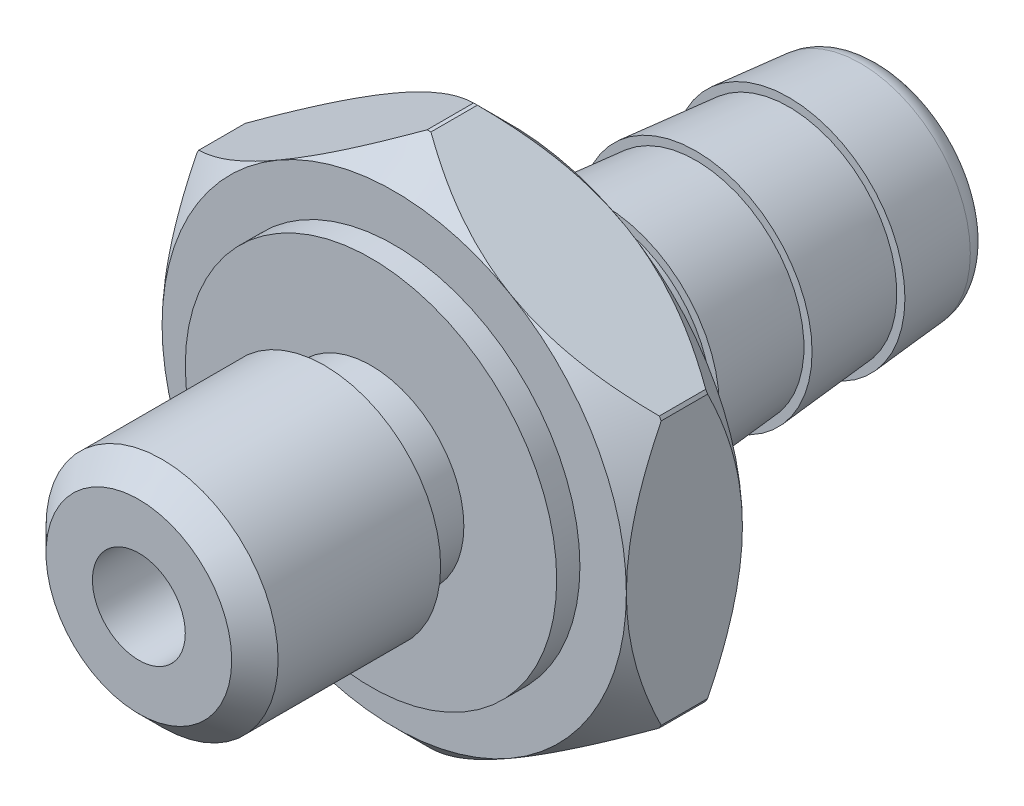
ISO-10303-21;
HEADER;
FILE_DESCRIPTION(('STEP AP214'),'2;1');
FILE_NAME('part.step','',(''),(''),'','','');
FILE_SCHEMA(('AUTOMOTIVE_DESIGN { 1 0 10303 214 1 1 1 1 }'));
ENDSEC;
DATA;
#1=APPLICATION_CONTEXT('core data for automotive mechanical design processes');
#2=APPLICATION_PROTOCOL_DEFINITION('international standard','automotive_design',2000,#1);
#3=PRODUCT_CONTEXT('',#1,'mechanical');
#4=PRODUCT('Part','Part','',(#3));
#5=PRODUCT_RELATED_PRODUCT_CATEGORY('part','',(#4));
#6=PRODUCT_DEFINITION_FORMATION('','',#4);
#7=PRODUCT_DEFINITION_CONTEXT('part definition',#1,'design');
#8=PRODUCT_DEFINITION('design','',#6,#7);
#9=PRODUCT_DEFINITION_SHAPE('','',#8);
#10=(LENGTH_UNIT() NAMED_UNIT(*) SI_UNIT(.MILLI.,.METRE.));
#11=(NAMED_UNIT(*) PLANE_ANGLE_UNIT() SI_UNIT($,.RADIAN.));
#12=(NAMED_UNIT(*) SI_UNIT($,.STERADIAN.) SOLID_ANGLE_UNIT());
#13=UNCERTAINTY_MEASURE_WITH_UNIT(LENGTH_MEASURE(1.E-05),#10,'distance_accuracy_value','');
#14=(GEOMETRIC_REPRESENTATION_CONTEXT(3) GLOBAL_UNCERTAINTY_ASSIGNED_CONTEXT((#13)) GLOBAL_UNIT_ASSIGNED_CONTEXT((#10,
#11,#12)) REPRESENTATION_CONTEXT('',''));
#15=CARTESIAN_POINT('',(0.,0.,0.));
#16=DIRECTION('',(0.,0.,1.));
#17=DIRECTION('',(1.,0.,0.));
#18=AXIS2_PLACEMENT_3D('',#15,#16,#17);
#19=CARTESIAN_POINT('',(0.,0.,0.));
#20=DIRECTION('',(0.,0.,1.));
#21=DIRECTION('',(1.,0.,0.));
#22=AXIS2_PLACEMENT_3D('',#19,#20,#21);
#23=PLANE('',#22);
#24=CARTESIAN_POINT('',(0.,0.,0.));
#25=DIRECTION('',(0.,0.,1.));
#26=DIRECTION('',(1.,0.,0.));
#27=AXIS2_PLACEMENT_3D('',#24,#25,#26);
#28=CIRCLE('',#27,5.);
#29=CARTESIAN_POINT('',(5.00000000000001,0.,0.));
#30=VERTEX_POINT('',#29);
#31=CARTESIAN_POINT('',(2.5,-4.33012701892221,0.));
#32=VERTEX_POINT('',#31);
#33=EDGE_CURVE('E408',#30,#32,#28,.F.);
#34=ORIENTED_EDGE('',*,*,#33,.T.);
#35=CARTESIAN_POINT('',(-2.49999999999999,-4.33012701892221,0.));
#36=VERTEX_POINT('',#35);
#37=EDGE_CURVE('E409',#32,#36,#28,.F.);
#38=ORIENTED_EDGE('',*,*,#37,.T.);
#39=CARTESIAN_POINT('',(-5.,0.,0.));
#40=VERTEX_POINT('',#39);
#41=EDGE_CURVE('E394',#36,#40,#28,.F.);
#42=ORIENTED_EDGE('',*,*,#41,.T.);
#43=CARTESIAN_POINT('',(-2.5,4.33012701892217,0.));
#44=VERTEX_POINT('',#43);
#45=EDGE_CURVE('E364',#40,#44,#28,.F.);
#46=ORIENTED_EDGE('',*,*,#45,.T.);
#47=CARTESIAN_POINT('',(2.50000000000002,4.33012701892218,0.));
#48=VERTEX_POINT('',#47);
#49=EDGE_CURVE('E404',#44,#48,#28,.F.);
#50=ORIENTED_EDGE('',*,*,#49,.T.);
#51=EDGE_CURVE('E384',#48,#30,#28,.F.);
#52=ORIENTED_EDGE('',*,*,#51,.T.);
#53=EDGE_LOOP('',(#34,#38,#42,#46,#50,#52));
#54=FACE_BOUND('',#53,.T.);
#55=CARTESIAN_POINT('',(0.,0.,0.));
#56=DIRECTION('',(0.,0.,1.));
#57=DIRECTION('',(1.,0.,0.));
#58=AXIS2_PLACEMENT_3D('',#55,#56,#57);
#59=CIRCLE('',#58,2.5);
#60=CARTESIAN_POINT('',(2.5,0.,0.));
#61=VERTEX_POINT('',#60);
#62=EDGE_CURVE('E480',#61,#61,#59,.F.);
#63=ORIENTED_EDGE('',*,*,#62,.F.);
#64=EDGE_LOOP('',(#63));
#65=FACE_BOUND('',#64,.T.);
#66=ADVANCED_FACE('F33',(#54,#65),#23,.F.);
#67=CARTESIAN_POINT('',(0.,0.,2.5));
#68=DIRECTION('',(0.,0.,1.));
#69=DIRECTION('',(1.,0.,0.));
#70=AXIS2_PLACEMENT_3D('',#67,#68,#69);
#71=PLANE('',#70);
#72=CARTESIAN_POINT('',(0.,0.,2.5));
#73=DIRECTION('',(0.,0.,1.));
#74=DIRECTION('',(1.,0.,0.));
#75=AXIS2_PLACEMENT_3D('',#72,#73,#74);
#76=CIRCLE('',#75,5.);
#77=CARTESIAN_POINT('',(5.,0.,2.50000000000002));
#78=VERTEX_POINT('',#77);
#79=CARTESIAN_POINT('',(2.50000000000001,4.33012701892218,2.50000000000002));
#80=VERTEX_POINT('',#79);
#81=EDGE_CURVE('E193',#78,#80,#76,.T.);
#82=ORIENTED_EDGE('',*,*,#81,.T.);
#83=CARTESIAN_POINT('',(-2.5,4.33012701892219,2.5));
#84=VERTEX_POINT('',#83);
#85=EDGE_CURVE('E194',#80,#84,#76,.T.);
#86=ORIENTED_EDGE('',*,*,#85,.T.);
#87=CARTESIAN_POINT('',(-5.,0.,2.50000000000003));
#88=VERTEX_POINT('',#87);
#89=EDGE_CURVE('E186',#84,#88,#76,.T.);
#90=ORIENTED_EDGE('',*,*,#89,.T.);
#91=CARTESIAN_POINT('',(-2.5,-4.33012701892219,2.5));
#92=VERTEX_POINT('',#91);
#93=EDGE_CURVE('E175',#88,#92,#76,.T.);
#94=ORIENTED_EDGE('',*,*,#93,.T.);
#95=CARTESIAN_POINT('',(2.50000000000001,-4.3301270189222,2.5));
#96=VERTEX_POINT('',#95);
#97=EDGE_CURVE('E179',#92,#96,#76,.T.);
#98=ORIENTED_EDGE('',*,*,#97,.T.);
#99=EDGE_CURVE('E184',#96,#78,#76,.T.);
#100=ORIENTED_EDGE('',*,*,#99,.T.);
#101=EDGE_LOOP('',(#82,#86,#90,#94,#98,#100));
#102=FACE_BOUND('',#101,.T.);
#103=CARTESIAN_POINT('',(0.,0.,2.5));
#104=DIRECTION('',(0.,0.,1.));
#105=DIRECTION('',(1.,0.,0.));
#106=AXIS2_PLACEMENT_3D('',#103,#104,#105);
#107=CIRCLE('',#106,4.);
#108=CARTESIAN_POINT('',(4.,0.,2.5));
#109=VERTEX_POINT('',#108);
#110=EDGE_CURVE('E427',#109,#109,#107,.T.);
#111=ORIENTED_EDGE('',*,*,#110,.F.);
#112=EDGE_LOOP('',(#111));
#113=FACE_BOUND('',#112,.T.);
#114=ADVANCED_FACE('F188',(#102,#113),#71,.T.);
#115=CARTESIAN_POINT('',(0.,0.,2.5));
#116=DIRECTION('',(0.,0.,-1.));
#117=DIRECTION('',(-1.,0.,0.));
#118=AXIS2_PLACEMENT_3D('',#115,#116,#117);
#119=CYLINDRICAL_SURFACE('',#118,5.75);
#120=CARTESIAN_POINT('',(0.,0.,1.74999999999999));
#121=DIRECTION('',(0.,0.,1.));
#122=DIRECTION('',(1.,0.,0.));
#123=AXIS2_PLACEMENT_3D('',#120,#121,#122);
#124=CIRCLE('',#123,5.75);
#125=CARTESIAN_POINT('',(5.00000000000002,-2.83945417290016,1.75));
#126=VERTEX_POINT('',#125);
#127=CARTESIAN_POINT('',(4.95903944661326,-2.91039993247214,1.75));
#128=VERTEX_POINT('',#127);
#129=EDGE_CURVE('E381',#126,#128,#124,.F.);
#130=ORIENTED_EDGE('',*,*,#129,.T.);
#131=DIRECTION('',(0.,0.,-1.));
#132=VECTOR('',#131,1.);
#133=CARTESIAN_POINT('',(4.95903944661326,-2.91039993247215,2.5));
#134=LINE('',#133,#132);
#135=CARTESIAN_POINT('',(4.95903944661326,-2.91039993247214,0.750000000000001));
#136=VERTEX_POINT('',#135);
#137=EDGE_CURVE('E329',#128,#136,#134,.T.);
#138=ORIENTED_EDGE('',*,*,#137,.T.);
#139=CARTESIAN_POINT('',(0.,0.,0.750000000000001));
#140=DIRECTION('',(0.,0.,1.));
#141=DIRECTION('',(1.,0.,0.));
#142=AXIS2_PLACEMENT_3D('',#139,#140,#141);
#143=CIRCLE('',#142,5.75);
#144=CARTESIAN_POINT('',(5.00000000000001,-2.83945417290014,0.750000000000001));
#145=VERTEX_POINT('',#144);
#146=EDGE_CURVE('E197',#136,#145,#143,.T.);
#147=ORIENTED_EDGE('',*,*,#146,.T.);
#148=DIRECTION('',(0.,0.,-1.));
#149=VECTOR('',#148,1.);
#150=CARTESIAN_POINT('',(5.,-2.83945417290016,2.5));
#151=LINE('',#150,#149);
#152=EDGE_CURVE('E227',#145,#126,#151,.F.);
#153=ORIENTED_EDGE('',*,*,#152,.T.);
#154=EDGE_LOOP('',(#130,#138,#147,#153));
#155=FACE_BOUND('',#154,.T.);
#156=ADVANCED_FACE('F508',(#155),#119,.T.);
#157=CARTESIAN_POINT('',(-0.0409605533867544,-5.74985410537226,0.750000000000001));
#158=VERTEX_POINT('',#157);
#159=CARTESIAN_POINT('',(0.0409605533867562,-5.74985410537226,0.750000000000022));
#160=VERTEX_POINT('',#159);
#161=EDGE_CURVE('E396',#158,#160,#143,.T.);
#162=ORIENTED_EDGE('',*,*,#161,.T.);
#163=DIRECTION('',(0.,0.,-1.));
#164=VECTOR('',#163,1.);
#165=CARTESIAN_POINT('',(0.0409605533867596,-5.74985410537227,2.50000000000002));
#166=LINE('',#165,#164);
#167=CARTESIAN_POINT('',(0.0409605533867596,-5.74985410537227,1.75000000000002));
#168=VERTEX_POINT('',#167);
#169=EDGE_CURVE('E167',#160,#168,#166,.F.);
#170=ORIENTED_EDGE('',*,*,#169,.T.);
#171=CARTESIAN_POINT('',(-0.0409605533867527,-5.74985410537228,1.75));
#172=VERTEX_POINT('',#171);
#173=EDGE_CURVE('E377',#168,#172,#124,.F.);
#174=ORIENTED_EDGE('',*,*,#173,.T.);
#175=DIRECTION('',(0.,0.,-1.));
#176=VECTOR('',#175,1.);
#177=CARTESIAN_POINT('',(-0.0409605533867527,-5.74985410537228,2.5));
#178=LINE('',#177,#176);
#179=EDGE_CURVE('E162',#172,#158,#178,.T.);
#180=ORIENTED_EDGE('',*,*,#179,.T.);
#181=EDGE_LOOP('',(#162,#170,#174,#180));
#182=FACE_BOUND('',#181,.T.);
#183=ADVANCED_FACE('F424',(#182),#119,.T.);
#184=CARTESIAN_POINT('',(0.,0.,2.5));
#185=DIRECTION('',(0.,0.,-1.));
#186=DIRECTION('',(-1.,0.,0.));
#187=AXIS2_PLACEMENT_3D('',#184,#185,#186);
#188=CONICAL_SURFACE('',#187,5.,0.785398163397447);
#189=CARTESIAN_POINT('',(4.95939017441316,-2.91019743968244,1.7498));
#190=CARTESIAN_POINT('',(4.87462984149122,-2.95913384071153,1.79812961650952));
#191=CARTESIAN_POINT('',(4.78922394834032,-3.00844295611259,1.84495251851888));
#192=CARTESIAN_POINT('',(4.61700027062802,-3.10787634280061,1.93513590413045));
#193=CARTESIAN_POINT('',(4.53018176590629,-3.15800102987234,1.97849455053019));
#194=CARTESIAN_POINT('',(4.26666213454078,-3.31014415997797,2.10305034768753));
#195=CARTESIAN_POINT('',(4.08776602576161,-3.4134298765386,2.17822090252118));
#196=CARTESIAN_POINT('',(3.72703851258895,-3.62169600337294,2.30683011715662));
#197=CARTESIAN_POINT('',(3.54529375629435,-3.72662638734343,2.3605833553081));
#198=CARTESIAN_POINT('',(3.26977762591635,-3.88569569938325,2.4226730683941));
#199=CARTESIAN_POINT('',(3.17754310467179,-3.93894732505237,2.44027181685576));
#200=CARTESIAN_POINT('',(2.99231956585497,-4.04588618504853,2.4689020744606));
#201=CARTESIAN_POINT('',(2.89933065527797,-4.09957335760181,2.47993449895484));
#202=CARTESIAN_POINT('',(2.67068403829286,-4.23158254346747,2.49854420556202));
#203=CARTESIAN_POINT('',(2.53477687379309,-4.3100485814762,2.50229321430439));
#204=CARTESIAN_POINT('',(2.26323112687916,-4.46682559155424,2.49498710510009));
#205=CARTESIAN_POINT('',(2.12759265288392,-4.54513650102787,2.48392689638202));
#206=CARTESIAN_POINT('',(1.85762035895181,-4.70100507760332,2.44765432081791));
#207=CARTESIAN_POINT('',(1.72328806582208,-4.77856186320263,2.42242704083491));
#208=CARTESIAN_POINT('',(1.45694195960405,-4.93233685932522,2.35918673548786));
#209=CARTESIAN_POINT('',(1.32492796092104,-5.00855517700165,2.32117473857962));
#210=CARTESIAN_POINT('',(1.09465502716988,-5.14150331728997,2.24441540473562));
#211=CARTESIAN_POINT('',(0.995807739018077,-5.19857282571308,2.20797516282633));
#212=CARTESIAN_POINT('',(0.799818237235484,-5.3117274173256,2.12944148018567));
#213=CARTESIAN_POINT('',(0.702676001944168,-5.36781251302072,2.08734811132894));
#214=CARTESIAN_POINT('',(0.510408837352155,-5.47881801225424,1.99839659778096));
#215=CARTESIAN_POINT('',(0.415278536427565,-5.53374151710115,1.95155381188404));
#216=CARTESIAN_POINT('',(0.226706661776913,-5.64261353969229,1.85366806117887));
#217=CARTESIAN_POINT('',(0.133264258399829,-5.69656253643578,1.80262723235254));
#218=CARTESIAN_POINT('',(0.0406098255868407,-5.75005659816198,1.74980000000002));
#219=B_SPLINE_CURVE_WITH_KNOTS('',3,(#189,#190,#191,#192,#193,#194,#195,#196,#197,#198,#199,
#200,#201,#202,#203,#204,#205,#206,#207,#208,#209,#210,#211,#212,#213,#214,#215,#216,#217,#218),
.UNSPECIFIED.,.F.,.F.,(4,2,2,2,2,2,2,2,2,2,2,2,2,2,4),(0.,0.32744598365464,0.655064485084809,
1.31366544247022,1.96220075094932,2.28586533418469,2.60948478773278,3.07968318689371,
3.55004326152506,4.02089939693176,4.49171766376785,4.85100916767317,5.21029610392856,
5.56845613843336,5.92643505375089),.UNSPECIFIED.);
#220=EDGE_CURVE('E336',#128,#96,#219,.T.);
#221=ORIENTED_EDGE('',*,*,#220,.F.);
#222=ORIENTED_EDGE('',*,*,#129,.F.);
#223=CARTESIAN_POINT('',(5.,-13.9710438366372,-7.3388027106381));
#224=CARTESIAN_POINT('',(5.00000000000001,-13.646026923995,-7.03282359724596));
#225=CARTESIAN_POINT('',(5.00000000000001,-13.3204328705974,-6.72745389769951));
#226=CARTESIAN_POINT('',(5.00000000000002,-12.6677448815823,-6.11828873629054));
#227=CARTESIAN_POINT('',(5.00000000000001,-12.34065087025,-5.81449335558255));
#228=CARTESIAN_POINT('',(5.00000000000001,-11.6837816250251,-5.20806141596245));
#229=CARTESIAN_POINT('',(5.00000000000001,-11.3540015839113,-4.90543005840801));
#230=CARTESIAN_POINT('',(5.00000000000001,-10.6921580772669,-4.30269163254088));
#231=CARTESIAN_POINT('',(5.00000000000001,-10.3600946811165,-4.00258448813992));
#232=CARTESIAN_POINT('',(5.00000000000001,-9.65807055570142,-3.37433861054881));
#233=CARTESIAN_POINT('',(5.00000000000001,-9.28778694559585,-3.04656011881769));
#234=CARTESIAN_POINT('',(5.00000000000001,-8.54240100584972,-2.39642406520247));
#235=CARTESIAN_POINT('',(5.00000000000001,-8.16729818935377,-2.07406705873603));
#236=CARTESIAN_POINT('',(5.00000000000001,-7.59995082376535,-1.59664418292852));
#237=CARTESIAN_POINT('',(5.00000000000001,-7.41018738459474,-1.438630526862));
#238=CARTESIAN_POINT('',(5.00000000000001,-7.02869047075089,-1.12500217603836));
#239=CARTESIAN_POINT('',(5.00000000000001,-6.83695703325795,-0.969387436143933));
#240=CARTESIAN_POINT('',(5.00000000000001,-6.45116428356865,-0.661131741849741));
#241=CARTESIAN_POINT('',(5.00000000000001,-6.25710537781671,-0.508490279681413));
#242=CARTESIAN_POINT('',(5.00000000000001,-5.86614940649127,-0.206894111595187));
#243=CARTESIAN_POINT('',(5.00000000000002,-5.66925248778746,-0.0579392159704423));
#244=CARTESIAN_POINT('',(5.00000000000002,-5.31564988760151,0.203067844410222));
#245=CARTESIAN_POINT('',(5.00000000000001,-5.15962120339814,0.316035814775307));
#246=CARTESIAN_POINT('',(5.00000000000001,-4.84509227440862,0.538495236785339));
#247=CARTESIAN_POINT('',(5.00000000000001,-4.68659197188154,0.647986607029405));
#248=CARTESIAN_POINT('',(5.00000000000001,-4.36643912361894,0.862855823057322));
#249=CARTESIAN_POINT('',(5.00000000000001,-4.20478185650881,0.96822666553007));
#250=CARTESIAN_POINT('',(5.00000000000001,-3.87808811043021,1.17359356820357));
#251=CARTESIAN_POINT('',(5.00000000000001,-3.71305176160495,1.27358983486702));
#252=CARTESIAN_POINT('',(5.00000000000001,-3.38251235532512,1.46480253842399));
#253=CARTESIAN_POINT('',(5.00000000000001,-3.21709138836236,1.55615894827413));
#254=CARTESIAN_POINT('',(5.00000000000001,-2.88199312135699,1.73065054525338));
#255=CARTESIAN_POINT('',(5.00000000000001,-2.71231493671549,1.81378400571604));
#256=CARTESIAN_POINT('',(5.00000000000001,-2.19702162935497,2.04716617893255));
#257=CARTESIAN_POINT('',(5.00000000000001,-1.84385830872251,2.18218028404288));
#258=CARTESIAN_POINT('',(5.00000000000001,-1.35750467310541,2.32036180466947));
#259=CARTESIAN_POINT('',(5.00000000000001,-1.23222568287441,2.35187547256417));
#260=CARTESIAN_POINT('',(5.00000000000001,-0.97978787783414,2.40639596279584));
#261=CARTESIAN_POINT('',(5.00000000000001,-0.852628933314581,2.4294021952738));
#262=CARTESIAN_POINT('',(5.00000000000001,-0.59736359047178,2.46602071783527));
#263=CARTESIAN_POINT('',(5.00000000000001,-0.469261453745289,2.47966245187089));
#264=CARTESIAN_POINT('',(5.00000000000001,-0.212381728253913,2.49713260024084));
#265=CARTESIAN_POINT('',(5.00000000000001,-0.0836041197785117,2.50096072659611));
#266=CARTESIAN_POINT('',(5.00000000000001,0.196531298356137,2.4984269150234));
#267=CARTESIAN_POINT('',(5.00000000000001,0.347875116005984,2.49015340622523));
#268=CARTESIAN_POINT('',(5.00000000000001,0.649240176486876,2.46025760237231));
#269=CARTESIAN_POINT('',(5.00000000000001,0.799261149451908,2.43863264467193));
#270=CARTESIAN_POINT('',(5.00000000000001,1.09873261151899,2.38284206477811));
#271=CARTESIAN_POINT('',(5.00000000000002,1.24815606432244,2.34853319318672));
#272=CARTESIAN_POINT('',(5.00000000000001,1.54399438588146,2.26897654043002));
#273=CARTESIAN_POINT('',(4.99999999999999,1.69040974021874,2.22373054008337));
#274=CARTESIAN_POINT('',(4.99999999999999,2.00041850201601,2.11691476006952));
#275=CARTESIAN_POINT('',(5.00000000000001,2.16352511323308,2.05394315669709));
#276=CARTESIAN_POINT('',(5.00000000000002,2.48562426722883,1.91815632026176));
#277=CARTESIAN_POINT('',(5.00000000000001,2.64461488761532,1.84533658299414));
#278=CARTESIAN_POINT('',(5.00000000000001,2.95921567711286,1.69155228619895));
#279=CARTESIAN_POINT('',(5.00000000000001,3.11481320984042,1.61056207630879));
#280=CARTESIAN_POINT('',(5.00000000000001,3.42247205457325,1.4422165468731));
#281=CARTESIAN_POINT('',(5.00000000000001,3.57453390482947,1.35486220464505));
#282=CARTESIAN_POINT('',(5.00000000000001,3.86922334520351,1.1788033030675));
#283=CARTESIAN_POINT('',(5.00000000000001,4.01197838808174,1.09031096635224));
#284=CARTESIAN_POINT('',(5.00000000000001,4.29501947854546,0.909450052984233));
#285=CARTESIAN_POINT('',(5.00000000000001,4.43530532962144,0.817081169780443));
#286=CARTESIAN_POINT('',(5.00000000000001,4.7125928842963,0.629910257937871));
#287=CARTESIAN_POINT('',(5.00000000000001,4.84961194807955,0.535133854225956));
#288=CARTESIAN_POINT('',(5.00000000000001,5.12174836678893,0.342967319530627));
#289=CARTESIAN_POINT('',(5.00000000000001,5.25686625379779,0.245577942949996));
#290=CARTESIAN_POINT('',(5.00000000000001,5.39118521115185,0.147117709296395));
#291=B_SPLINE_CURVE_WITH_KNOTS('',3,(#223,#224,#225,#226,#227,#228,#229,#230,#231,#232,#233,
#234,#235,#236,#237,#238,#239,#240,#241,#242,#243,#244,#245,#246,#247,#248,#249,#250,#251,#252,
#253,#254,#255,#256,#257,#258,#259,#260,#261,#262,#263,#264,#265,#266,#267,#268,#269,#270,#271,
#272,#273,#274,#275,#276,#277,#278,#279,#280,#281,#282,#283,#284,#285,#286,#287,#288,#289,#290),
.UNSPECIFIED.,.F.,.F.,(4,2,2,2,2,2,2,2,2,2,2,2,2,2,2,2,2,2,2,2,2,2,2,2,2,2,2,2,2,2,2,2,2,4),(0.,
1.33915674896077,2.6783818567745,4.0211544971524,5.36388651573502,6.84740856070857,
8.3310816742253,9.07188131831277,9.81266700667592,10.5533250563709,11.2939449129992,
11.8717998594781,12.449668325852,13.0284796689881,13.6072687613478,14.1739417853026,
14.7407335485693,15.8698076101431,16.2571216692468,16.6444625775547,17.0305799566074,
17.4167086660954,17.8707806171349,18.324943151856,18.7843999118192,19.2437819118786,
19.7678989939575,20.292256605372,20.8183148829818,21.3442925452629,21.8480932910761,
22.3519339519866,22.8517119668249,23.3513472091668),.UNSPECIFIED.);
#292=EDGE_CURVE('E557',#78,#126,#291,.F.);
#293=ORIENTED_EDGE('',*,*,#292,.F.);
#294=ORIENTED_EDGE('',*,*,#99,.F.);
#295=EDGE_LOOP('',(#221,#222,#293,#294));
#296=FACE_BOUND('',#295,.T.);
#297=ADVANCED_FACE('F516',(#296),#188,.T.);
#298=EDGE_CURVE('E181',#96,#168,#219,.T.);
#299=ORIENTED_EDGE('',*,*,#298,.F.);
#300=ORIENTED_EDGE('',*,*,#97,.F.);
#301=CARTESIAN_POINT('',(-0.0406098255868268,-5.75005659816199,1.7498));
#302=CARTESIAN_POINT('',(-0.125370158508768,-5.70112019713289,1.79812961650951));
#303=CARTESIAN_POINT('',(-0.210776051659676,-5.65181108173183,1.84495251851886));
#304=CARTESIAN_POINT('',(-0.382999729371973,-5.55237769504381,1.93513590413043));
#305=CARTESIAN_POINT('',(-0.469818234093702,-5.50225300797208,1.97849455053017));
#306=CARTESIAN_POINT('',(-0.733337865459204,-5.35010987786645,2.10305034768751));
#307=CARTESIAN_POINT('',(-0.91223397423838,-5.24682416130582,2.17822090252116));
#308=CARTESIAN_POINT('',(-1.27296148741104,-5.03855803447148,2.30683011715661));
#309=CARTESIAN_POINT('',(-1.45470624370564,-4.93362765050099,2.36058335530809));
#310=CARTESIAN_POINT('',(-1.73022237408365,-4.77455833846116,2.42267306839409));
#311=CARTESIAN_POINT('',(-1.8224568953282,-4.72130671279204,2.44027181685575));
#312=CARTESIAN_POINT('',(-2.00768043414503,-4.61436785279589,2.4689020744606));
#313=CARTESIAN_POINT('',(-2.10066934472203,-4.56068068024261,2.47993449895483));
#314=CARTESIAN_POINT('',(-2.32931596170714,-4.42867149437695,2.49854420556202));
#315=CARTESIAN_POINT('',(-2.46522312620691,-4.35020545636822,2.50229321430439));
#316=CARTESIAN_POINT('',(-2.73676887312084,-4.19342844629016,2.49498710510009));
#317=CARTESIAN_POINT('',(-2.87240734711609,-4.11511753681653,2.48392689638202));
#318=CARTESIAN_POINT('',(-3.14237964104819,-3.95924896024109,2.4476543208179));
#319=CARTESIAN_POINT('',(-3.27671193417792,-3.88169217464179,2.4224270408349));
#320=CARTESIAN_POINT('',(-3.54305804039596,-3.72791717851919,2.35918673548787));
#321=CARTESIAN_POINT('',(-3.67507203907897,-3.65169886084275,2.32117473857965));
#322=CARTESIAN_POINT('',(-3.90534497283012,-3.51875072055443,2.24441540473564));
#323=CARTESIAN_POINT('',(-4.00419226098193,-3.46168121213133,2.20797516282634));
#324=CARTESIAN_POINT('',(-4.20018176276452,-3.34852662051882,2.12944148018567));
#325=CARTESIAN_POINT('',(-4.29732399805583,-3.29244152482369,2.08734811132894));
#326=CARTESIAN_POINT('',(-4.48959116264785,-3.18143602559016,1.99839659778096));
#327=CARTESIAN_POINT('',(-4.58472146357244,-3.12651252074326,1.95155381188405));
#328=CARTESIAN_POINT('',(-4.77329333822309,-3.01764049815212,1.85366806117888));
#329=CARTESIAN_POINT('',(-4.86673574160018,-2.96369150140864,1.80262723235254));
#330=CARTESIAN_POINT('',(-4.95939017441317,-2.91019743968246,1.7498));
#331=B_SPLINE_CURVE_WITH_KNOTS('',3,(#301,#302,#303,#304,#305,#306,#307,#308,#309,#310,#311,
#312,#313,#314,#315,#316,#317,#318,#319,#320,#321,#322,#323,#324,#325,#326,#327,#328,#329,#330),
.UNSPECIFIED.,.F.,.F.,(4,2,2,2,2,2,2,2,2,2,2,2,2,2,4),(0.,0.327445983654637,0.655064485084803,
1.31366544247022,1.96220075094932,2.28586533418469,2.60948478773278,3.07968318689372,
3.55004326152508,4.02089939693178,4.49171766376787,4.85100916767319,5.21029610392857,
5.56845613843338,5.92643505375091),.UNSPECIFIED.);
#332=EDGE_CURVE('E156',#172,#92,#331,.T.);
#333=ORIENTED_EDGE('',*,*,#332,.F.);
#334=ORIENTED_EDGE('',*,*,#173,.F.);
#335=EDGE_LOOP('',(#299,#300,#333,#334));
#336=FACE_BOUND('',#335,.T.);
#337=ADVANCED_FACE('F180',(#336),#188,.T.);
#338=CARTESIAN_POINT('',(0.,0.,0.750000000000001));
#339=DIRECTION('',(0.,0.,1.));
#340=DIRECTION('',(1.,0.,0.));
#341=AXIS2_PLACEMENT_3D('',#338,#339,#340);
#342=CONICAL_SURFACE('',#341,5.75,0.78539816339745);
#343=CARTESIAN_POINT('',(0.0406098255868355,-5.75005659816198,0.750200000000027));
#344=CARTESIAN_POINT('',(0.125370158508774,-5.70112019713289,0.701870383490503));
#345=CARTESIAN_POINT('',(0.210776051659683,-5.65181108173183,0.65504748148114));
#346=CARTESIAN_POINT('',(0.382999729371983,-5.55237769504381,0.564864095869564));
#347=CARTESIAN_POINT('',(0.469818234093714,-5.50225300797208,0.521505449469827));
#348=CARTESIAN_POINT('',(0.733337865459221,-5.35010987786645,0.396949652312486));
#349=CARTESIAN_POINT('',(0.912233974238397,-5.24682416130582,0.321779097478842));
#350=CARTESIAN_POINT('',(1.27296148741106,-5.03855803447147,0.193169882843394));
#351=CARTESIAN_POINT('',(1.45470624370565,-4.93362765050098,0.13941664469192));
#352=CARTESIAN_POINT('',(1.73022237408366,-4.77455833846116,0.0773269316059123));
#353=CARTESIAN_POINT('',(1.82245689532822,-4.72130671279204,0.059728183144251));
#354=CARTESIAN_POINT('',(2.00768043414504,-4.61436785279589,0.0310979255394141));
#355=CARTESIAN_POINT('',(2.10066934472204,-4.56068068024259,0.0200655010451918));
#356=CARTESIAN_POINT('',(2.32931596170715,-4.42867149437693,0.00145579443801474));
#357=CARTESIAN_POINT('',(2.46522312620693,-4.35020545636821,-0.00229321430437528));
#358=CARTESIAN_POINT('',(2.73676887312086,-4.19342844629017,0.0050128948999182));
#359=CARTESIAN_POINT('',(2.87240734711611,-4.11511753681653,0.0160731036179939));
#360=CARTESIAN_POINT('',(3.14237964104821,-3.95924896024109,0.0523456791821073));
#361=CARTESIAN_POINT('',(3.27671193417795,-3.88169217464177,0.0775729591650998));
#362=CARTESIAN_POINT('',(3.54305804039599,-3.72791717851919,0.140813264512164));
#363=CARTESIAN_POINT('',(3.675072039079,-3.65169886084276,0.178825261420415));
#364=CARTESIAN_POINT('',(3.90534497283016,-3.51875072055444,0.255584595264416));
#365=CARTESIAN_POINT('',(4.00419226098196,-3.46168121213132,0.292024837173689));
#366=CARTESIAN_POINT('',(4.20018176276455,-3.3485266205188,0.370558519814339));
#367=CARTESIAN_POINT('',(4.29732399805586,-3.29244152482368,0.41265188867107));
#368=CARTESIAN_POINT('',(4.48959116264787,-3.18143602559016,0.501603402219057));
#369=CARTESIAN_POINT('',(4.58472146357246,-3.12651252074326,0.548446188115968));
#370=CARTESIAN_POINT('',(4.77329333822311,-3.01764049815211,0.64633193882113));
#371=CARTESIAN_POINT('',(4.86673574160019,-2.96369150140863,0.697372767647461));
#372=CARTESIAN_POINT('',(4.95939017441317,-2.91019743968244,0.7502));
#373=B_SPLINE_CURVE_WITH_KNOTS('',3,(#343,#344,#345,#346,#347,#348,#349,#350,#351,#352,#353,
#354,#355,#356,#357,#358,#359,#360,#361,#362,#363,#364,#365,#366,#367,#368,#369,#370,#371,#372),
.UNSPECIFIED.,.F.,.F.,(4,2,2,2,2,2,2,2,2,2,2,2,2,2,4),(0.,0.327445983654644,0.655064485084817,
1.31366544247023,1.96220075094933,2.2858653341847,2.60948478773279,3.07968318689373,
3.5500432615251,4.0208993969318,4.4917176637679,4.85100916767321,5.21029610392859,
5.56845613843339,5.92643505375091),.UNSPECIFIED.);
#374=EDGE_CURVE('E56',#160,#32,#373,.T.);
#375=ORIENTED_EDGE('',*,*,#374,.F.);
#376=ORIENTED_EDGE('',*,*,#161,.F.);
#377=CARTESIAN_POINT('',(-4.95939017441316,-2.91019743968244,0.7502));
#378=CARTESIAN_POINT('',(-4.87462984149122,-2.95913384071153,0.701870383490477));
#379=CARTESIAN_POINT('',(-4.78922394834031,-3.00844295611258,0.655047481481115));
#380=CARTESIAN_POINT('',(-4.61700027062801,-3.10787634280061,0.56486409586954));
#381=CARTESIAN_POINT('',(-4.53018176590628,-3.15800102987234,0.521505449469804));
#382=CARTESIAN_POINT('',(-4.26666213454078,-3.31014415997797,0.396949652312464));
#383=CARTESIAN_POINT('',(-4.0877660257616,-3.4134298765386,0.321779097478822));
#384=CARTESIAN_POINT('',(-3.72703851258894,-3.62169600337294,0.193169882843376));
#385=CARTESIAN_POINT('',(-3.54529375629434,-3.72662638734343,0.139416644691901));
#386=CARTESIAN_POINT('',(-3.26977762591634,-3.88569569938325,0.0773269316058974));
#387=CARTESIAN_POINT('',(-3.17754310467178,-3.93894732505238,0.0597281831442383));
#388=CARTESIAN_POINT('',(-2.99231956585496,-4.04588618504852,0.0310979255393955));
#389=CARTESIAN_POINT('',(-2.89933065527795,-4.09957335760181,0.020065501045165));
#390=CARTESIAN_POINT('',(-2.67068403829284,-4.23158254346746,0.00145579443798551));
#391=CARTESIAN_POINT('',(-2.53477687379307,-4.3100485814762,-0.00229321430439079));
#392=CARTESIAN_POINT('',(-2.26323112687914,-4.46682559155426,0.00501289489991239));
#393=CARTESIAN_POINT('',(-2.12759265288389,-4.54513650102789,0.0160731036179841));
#394=CARTESIAN_POINT('',(-1.85762035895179,-4.70100507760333,0.0523456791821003));
#395=CARTESIAN_POINT('',(-1.72328806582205,-4.77856186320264,0.0775729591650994));
#396=CARTESIAN_POINT('',(-1.45694195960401,-4.93233685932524,0.140813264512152));
#397=CARTESIAN_POINT('',(-1.32492796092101,-5.00855517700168,0.178825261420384));
#398=CARTESIAN_POINT('',(-1.09465502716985,-5.14150331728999,0.25558459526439));
#399=CARTESIAN_POINT('',(-0.995807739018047,-5.19857282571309,0.29202483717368));
#400=CARTESIAN_POINT('',(-0.799818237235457,-5.31172741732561,0.370558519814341));
#401=CARTESIAN_POINT('',(-0.702676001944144,-5.36781251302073,0.412651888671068));
#402=CARTESIAN_POINT('',(-0.510408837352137,-5.47881801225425,0.501603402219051));
#403=CARTESIAN_POINT('',(-0.415278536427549,-5.53374151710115,0.548446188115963));
#404=CARTESIAN_POINT('',(-0.2267066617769,-5.6426135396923,0.64633193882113));
#405=CARTESIAN_POINT('',(-0.133264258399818,-5.69656253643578,0.697372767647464));
#406=CARTESIAN_POINT('',(-0.040609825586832,-5.75005659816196,0.750200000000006));
#407=B_SPLINE_CURVE_WITH_KNOTS('',3,(#377,#378,#379,#380,#381,#382,#383,#384,#385,#386,#387,
#388,#389,#390,#391,#392,#393,#394,#395,#396,#397,#398,#399,#400,#401,#402,#403,#404,#405,#406),
.UNSPECIFIED.,.F.,.F.,(4,2,2,2,2,2,2,2,2,2,2,2,2,2,4),(0.,0.32744598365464,0.655064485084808,
1.31366544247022,1.96220075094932,2.28586533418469,2.60948478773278,3.07968318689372,
3.55004326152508,4.02089939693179,4.49171766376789,4.8510091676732,5.21029610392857,
5.56845613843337,5.92643505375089),.UNSPECIFIED.);
#408=EDGE_CURVE('E299',#36,#158,#407,.T.);
#409=ORIENTED_EDGE('',*,*,#408,.F.);
#410=ORIENTED_EDGE('',*,*,#37,.F.);
#411=EDGE_LOOP('',(#375,#376,#409,#410));
#412=FACE_BOUND('',#411,.T.);
#413=ADVANCED_FACE('F277',(#412),#342,.T.);
#414=CARTESIAN_POINT('',(-4.95903944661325,-2.91039993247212,0.750000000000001));
#415=VERTEX_POINT('',#414);
#416=EDGE_CURVE('E48',#415,#36,#407,.T.);
#417=ORIENTED_EDGE('',*,*,#416,.F.);
#418=CARTESIAN_POINT('',(-5.,-2.83945417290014,0.750000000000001));
#419=VERTEX_POINT('',#418);
#420=EDGE_CURVE('E380',#419,#415,#143,.T.);
#421=ORIENTED_EDGE('',*,*,#420,.F.);
#422=CARTESIAN_POINT('',(-5.00000000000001,-13.9710438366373,9.83880271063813));
#423=CARTESIAN_POINT('',(-5.00000000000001,-13.6460269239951,9.53282359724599));
#424=CARTESIAN_POINT('',(-5.00000000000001,-13.3204328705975,9.22745389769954));
#425=CARTESIAN_POINT('',(-5.00000000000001,-12.6677448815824,8.61828873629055));
#426=CARTESIAN_POINT('',(-5.00000000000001,-12.34065087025,8.31449335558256));
#427=CARTESIAN_POINT('',(-5.00000000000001,-11.6837816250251,7.70806141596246));
#428=CARTESIAN_POINT('',(-5.,-11.3540015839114,7.40543005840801));
#429=CARTESIAN_POINT('',(-5.,-10.6921580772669,6.80269163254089));
#430=CARTESIAN_POINT('',(-5.,-10.3600946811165,6.50258448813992));
#431=CARTESIAN_POINT('',(-5.,-9.65807055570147,5.87433861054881));
#432=CARTESIAN_POINT('',(-5.,-9.2877869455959,5.54656011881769));
#433=CARTESIAN_POINT('',(-5.,-8.54240100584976,4.89642406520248));
#434=CARTESIAN_POINT('',(-5.,-8.16729818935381,4.57406705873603));
#435=CARTESIAN_POINT('',(-5.,-7.59995082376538,4.09664418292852));
#436=CARTESIAN_POINT('',(-5.,-7.41018738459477,3.938630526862));
#437=CARTESIAN_POINT('',(-5.,-7.02869047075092,3.62500217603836));
#438=CARTESIAN_POINT('',(-5.,-6.83695703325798,3.46938743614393));
#439=CARTESIAN_POINT('',(-5.,-6.45116428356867,3.16113174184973));
#440=CARTESIAN_POINT('',(-5.,-6.25710537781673,3.0084902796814));
#441=CARTESIAN_POINT('',(-5.,-5.86614940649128,2.70689411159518));
#442=CARTESIAN_POINT('',(-5.,-5.66925248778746,2.55793921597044));
#443=CARTESIAN_POINT('',(-5.,-5.31564988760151,2.29693215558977));
#444=CARTESIAN_POINT('',(-5.,-5.15962120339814,2.18396418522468));
#445=CARTESIAN_POINT('',(-5.,-4.84509227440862,1.96150476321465));
#446=CARTESIAN_POINT('',(-5.,-4.68659197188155,1.85201339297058));
#447=CARTESIAN_POINT('',(-5.,-4.36643912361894,1.63714417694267));
#448=CARTESIAN_POINT('',(-5.,-4.20478185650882,1.53177333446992));
#449=CARTESIAN_POINT('',(-5.,-3.87808811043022,1.32640643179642));
#450=CARTESIAN_POINT('',(-5.,-3.71305176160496,1.22641016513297));
#451=CARTESIAN_POINT('',(-5.,-3.38251235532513,1.035197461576));
#452=CARTESIAN_POINT('',(-5.,-3.21709138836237,0.943841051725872));
#453=CARTESIAN_POINT('',(-5.,-2.881993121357,0.769349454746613));
#454=CARTESIAN_POINT('',(-5.,-2.71231493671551,0.686215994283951));
#455=CARTESIAN_POINT('',(-5.,-2.19702162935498,0.45283382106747));
#456=CARTESIAN_POINT('',(-5.,-1.84385830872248,0.317819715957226));
#457=CARTESIAN_POINT('',(-5.,-1.3575046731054,0.179638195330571));
#458=CARTESIAN_POINT('',(-5.,-1.2322256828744,0.148124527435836));
#459=CARTESIAN_POINT('',(-5.,-0.979787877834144,0.0936040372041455));
#460=CARTESIAN_POINT('',(-5.,-0.852628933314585,0.0705978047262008));
#461=CARTESIAN_POINT('',(-5.,-0.597363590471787,0.033979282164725));
#462=CARTESIAN_POINT('',(-5.,-0.469261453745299,0.0203375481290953));
#463=CARTESIAN_POINT('',(-5.,-0.212381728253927,0.00286739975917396));
#464=CARTESIAN_POINT('',(-5.,-0.0836041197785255,-0.000960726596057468));
#465=CARTESIAN_POINT('',(-5.,0.19653129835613,0.00157308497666));
#466=CARTESIAN_POINT('',(-5.,0.347875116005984,0.00984659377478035));
#467=CARTESIAN_POINT('',(-5.,0.649240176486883,0.039742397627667));
#468=CARTESIAN_POINT('',(-5.,0.799261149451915,0.0613673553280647));
#469=CARTESIAN_POINT('',(-5.,1.098732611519,0.117157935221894));
#470=CARTESIAN_POINT('',(-5.,1.24815606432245,0.151466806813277));
#471=CARTESIAN_POINT('',(-5.,1.54399438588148,0.231023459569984));
#472=CARTESIAN_POINT('',(-4.99999999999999,1.69040974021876,0.276269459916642));
#473=CARTESIAN_POINT('',(-4.99999999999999,2.00041850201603,0.383085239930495));
#474=CARTESIAN_POINT('',(-5.,2.16352511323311,0.446056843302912));
#475=CARTESIAN_POINT('',(-5.,2.48562426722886,0.581843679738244));
#476=CARTESIAN_POINT('',(-5.,2.64461488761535,0.654663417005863));
#477=CARTESIAN_POINT('',(-5.,2.95921567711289,0.808447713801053));
#478=CARTESIAN_POINT('',(-5.,3.11481320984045,0.889437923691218));
#479=CARTESIAN_POINT('',(-5.,3.42247205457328,1.0577834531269));
#480=CARTESIAN_POINT('',(-5.,3.57453390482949,1.14513779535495));
#481=CARTESIAN_POINT('',(-5.,3.86922334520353,1.32119669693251));
#482=CARTESIAN_POINT('',(-5.,4.01197838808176,1.40968903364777));
#483=CARTESIAN_POINT('',(-5.,4.29501947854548,1.59054994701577));
#484=CARTESIAN_POINT('',(-5.,4.43530532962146,1.68291883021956));
#485=CARTESIAN_POINT('',(-5.,4.71259288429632,1.87008974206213));
#486=CARTESIAN_POINT('',(-5.,4.84961194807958,1.96486614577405));
#487=CARTESIAN_POINT('',(-5.,5.12174836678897,2.15703268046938));
#488=CARTESIAN_POINT('',(-5.,5.25686625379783,2.25442205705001));
#489=CARTESIAN_POINT('',(-5.00000000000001,5.3911852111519,2.3528822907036));
#490=B_SPLINE_CURVE_WITH_KNOTS('',3,(#422,#423,#424,#425,#426,#427,#428,#429,#430,#431,#432,
#433,#434,#435,#436,#437,#438,#439,#440,#441,#442,#443,#444,#445,#446,#447,#448,#449,#450,#451,
#452,#453,#454,#455,#456,#457,#458,#459,#460,#461,#462,#463,#464,#465,#466,#467,#468,#469,#470,
#471,#472,#473,#474,#475,#476,#477,#478,#479,#480,#481,#482,#483,#484,#485,#486,#487,#488,#489),
.UNSPECIFIED.,.F.,.F.,(4,2,2,2,2,2,2,2,2,2,2,2,2,2,2,2,2,2,2,2,2,2,2,2,2,2,2,2,2,2,2,2,2,4),(0.,
1.33915674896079,2.67838185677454,4.02115449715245,5.36388651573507,6.84740856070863,
8.33108167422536,9.07188131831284,9.812667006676,10.553325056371,11.2939449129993,
11.8717998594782,12.4496683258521,13.0284796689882,13.6072687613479,14.1739417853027,
14.7407335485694,15.8698076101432,16.2571216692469,16.6444625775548,17.0305799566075,
17.4167086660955,17.870780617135,18.3249431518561,18.7843999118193,19.2437819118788,
19.7678989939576,20.2922566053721,20.8183148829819,21.344292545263,21.8480932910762,
22.3519339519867,22.851711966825,23.351347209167),.UNSPECIFIED.);
#491=EDGE_CURVE('E256',#40,#419,#490,.F.);
#492=ORIENTED_EDGE('',*,*,#491,.F.);
#493=ORIENTED_EDGE('',*,*,#41,.F.);
#494=EDGE_LOOP('',(#417,#421,#492,#493));
#495=FACE_BOUND('',#494,.T.);
#496=ADVANCED_FACE('F393',(#495),#342,.T.);
#497=CARTESIAN_POINT('',(-0.0406098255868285,5.75005659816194,0.750200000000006));
#498=CARTESIAN_POINT('',(-0.125370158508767,5.70112019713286,0.701870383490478));
#499=CARTESIAN_POINT('',(-0.210776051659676,5.6518110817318,0.655047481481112));
#500=CARTESIAN_POINT('',(-0.382999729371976,5.55237769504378,0.564864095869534));
#501=CARTESIAN_POINT('',(-0.469818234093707,5.50225300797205,0.521505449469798));
#502=CARTESIAN_POINT('',(-0.733337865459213,5.35010987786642,0.396949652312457));
#503=CARTESIAN_POINT('',(-0.912233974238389,5.24682416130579,0.321779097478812));
#504=CARTESIAN_POINT('',(-1.27296148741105,5.03855803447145,0.193169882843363));
#505=CARTESIAN_POINT('',(-1.45470624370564,4.93362765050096,0.139416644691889));
#506=CARTESIAN_POINT('',(-1.73022237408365,4.77455833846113,0.0773269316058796));
#507=CARTESIAN_POINT('',(-1.82245689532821,4.72130671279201,0.0597281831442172));
#508=CARTESIAN_POINT('',(-2.00768043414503,4.61436785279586,0.0310979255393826));
#509=CARTESIAN_POINT('',(-2.10066934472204,4.56068068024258,0.0200655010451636));
#510=CARTESIAN_POINT('',(-2.32931596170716,4.42867149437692,0.00145579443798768));
#511=CARTESIAN_POINT('',(-2.46522312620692,4.35020545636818,-0.00229321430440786));
#512=CARTESIAN_POINT('',(-2.73676887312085,4.19342844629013,0.00501289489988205));
#513=CARTESIAN_POINT('',(-2.8724073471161,4.1151175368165,0.0160731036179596));
#514=CARTESIAN_POINT('',(-3.14237964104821,3.95924896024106,0.0523456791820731));
#515=CARTESIAN_POINT('',(-3.27671193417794,3.88169217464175,0.0775729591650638));
#516=CARTESIAN_POINT('',(-3.54305804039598,3.72791717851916,0.140813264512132));
#517=CARTESIAN_POINT('',(-3.67507203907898,3.65169886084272,0.178825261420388));
#518=CARTESIAN_POINT('',(-3.90534497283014,3.51875072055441,0.255584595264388));
#519=CARTESIAN_POINT('',(-4.00419226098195,3.46168121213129,0.292024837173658));
#520=CARTESIAN_POINT('',(-4.20018176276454,3.34852662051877,0.370558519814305));
#521=CARTESIAN_POINT('',(-4.29732399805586,3.29244152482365,0.412651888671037));
#522=CARTESIAN_POINT('',(-4.48959116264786,3.18143602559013,0.501603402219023));
#523=CARTESIAN_POINT('',(-4.58472146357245,3.12651252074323,0.548446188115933));
#524=CARTESIAN_POINT('',(-4.7732933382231,3.01764049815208,0.646331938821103));
#525=CARTESIAN_POINT('',(-4.86673574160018,2.9636915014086,0.697372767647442));
#526=CARTESIAN_POINT('',(-4.95939017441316,2.91019743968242,0.7502));
#527=B_SPLINE_CURVE_WITH_KNOTS('',3,(#497,#498,#499,#500,#501,#502,#503,#504,#505,#506,#507,
#508,#509,#510,#511,#512,#513,#514,#515,#516,#517,#518,#519,#520,#521,#522,#523,#524,#525,#526),
.UNSPECIFIED.,.F.,.F.,(4,2,2,2,2,2,2,2,2,2,2,2,2,2,4),(0.,0.327445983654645,0.655064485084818,
1.31366544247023,1.96220075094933,2.2858653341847,2.6094847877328,3.07968318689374,
3.5500432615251,4.0208993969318,4.4917176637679,4.85100916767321,5.21029610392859,
5.56845613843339,5.92643505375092),.UNSPECIFIED.);
#528=CARTESIAN_POINT('',(-0.0409605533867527,5.74985410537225,0.750000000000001));
#529=VERTEX_POINT('',#528);
#530=EDGE_CURVE('E353',#529,#44,#527,.T.);
#531=ORIENTED_EDGE('',*,*,#530,.F.);
#532=CARTESIAN_POINT('',(0.0409605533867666,5.74985410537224,0.750000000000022));
#533=VERTEX_POINT('',#532);
#534=EDGE_CURVE('E379',#533,#529,#143,.T.);
#535=ORIENTED_EDGE('',*,*,#534,.F.);
#536=CARTESIAN_POINT('',(4.95939017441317,2.91019743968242,0.750200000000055));
#537=CARTESIAN_POINT('',(4.87462984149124,2.95913384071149,0.701870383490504));
#538=CARTESIAN_POINT('',(4.78922394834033,3.00844295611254,0.655047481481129));
#539=CARTESIAN_POINT('',(4.61700027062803,3.10787634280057,0.564864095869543));
#540=CARTESIAN_POINT('',(4.5301817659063,3.1580010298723,0.521505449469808));
#541=CARTESIAN_POINT('',(4.26666213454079,3.31014415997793,0.396949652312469));
#542=CARTESIAN_POINT('',(4.08776602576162,3.41342987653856,0.321779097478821));
#543=CARTESIAN_POINT('',(3.72703851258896,3.6216960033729,0.193169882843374));
#544=CARTESIAN_POINT('',(3.54529375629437,3.72662638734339,0.139416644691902));
#545=CARTESIAN_POINT('',(3.26977762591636,3.88569569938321,0.0773269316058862));
#546=CARTESIAN_POINT('',(3.1775431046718,3.93894732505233,0.0597281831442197));
#547=CARTESIAN_POINT('',(2.99231956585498,4.04588618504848,0.0310979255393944));
#548=CARTESIAN_POINT('',(2.89933065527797,4.09957335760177,0.0200655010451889));
#549=CARTESIAN_POINT('',(2.67068403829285,4.23158254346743,0.00145579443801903));
#550=CARTESIAN_POINT('',(2.53477687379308,4.31004858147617,-0.00229321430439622));
#551=CARTESIAN_POINT('',(2.26323112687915,4.46682559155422,0.00501289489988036));
#552=CARTESIAN_POINT('',(2.1275926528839,4.54513650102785,0.0160731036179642));
#553=CARTESIAN_POINT('',(1.85762035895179,4.70100507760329,0.052345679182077));
#554=CARTESIAN_POINT('',(1.72328806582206,4.7785618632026,0.0775729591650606));
#555=CARTESIAN_POINT('',(1.45694195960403,4.9323368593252,0.140813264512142));
#556=CARTESIAN_POINT('',(1.32492796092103,5.00855517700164,0.178825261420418));
#557=CARTESIAN_POINT('',(1.09465502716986,5.14150331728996,0.255584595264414));
#558=CARTESIAN_POINT('',(0.995807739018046,5.19857282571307,0.292024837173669));
#559=CARTESIAN_POINT('',(0.799818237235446,5.31172741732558,0.370558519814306));
#560=CARTESIAN_POINT('',(0.702676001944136,5.36781251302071,0.412651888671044));
#561=CARTESIAN_POINT('',(0.510408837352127,5.47881801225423,0.501603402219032));
#562=CARTESIAN_POINT('',(0.415278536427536,5.53374151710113,0.54844618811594));
#563=CARTESIAN_POINT('',(0.22670666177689,5.64261353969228,0.646331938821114));
#564=CARTESIAN_POINT('',(0.133264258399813,5.69656253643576,0.697372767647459));
#565=CARTESIAN_POINT('',(0.0406098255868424,5.75005659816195,0.750200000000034));
#566=B_SPLINE_CURVE_WITH_KNOTS('',3,(#536,#537,#538,#539,#540,#541,#542,#543,#544,#545,#546,
#547,#548,#549,#550,#551,#552,#553,#554,#555,#556,#557,#558,#559,#560,#561,#562,#563,#564,#565),
.UNSPECIFIED.,.F.,.F.,(4,2,2,2,2,2,2,2,2,2,2,2,2,2,4),(0.,0.327445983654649,0.655064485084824,
1.31366544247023,1.96220075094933,2.28586533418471,2.6094847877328,3.07968318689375,
3.55004326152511,4.02089939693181,4.49171766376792,4.85100916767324,5.21029610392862,
5.56845613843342,5.92643505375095),.UNSPECIFIED.);
#567=EDGE_CURVE('E286',#48,#533,#566,.T.);
#568=ORIENTED_EDGE('',*,*,#567,.F.);
#569=ORIENTED_EDGE('',*,*,#49,.F.);
#570=EDGE_LOOP('',(#531,#535,#568,#569));
#571=FACE_BOUND('',#570,.T.);
#572=ADVANCED_FACE('F400',(#571),#342,.T.);
#573=CARTESIAN_POINT('',(4.95903944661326,2.91039993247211,0.750000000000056));
#574=VERTEX_POINT('',#573);
#575=EDGE_CURVE('E344',#574,#48,#566,.T.);
#576=ORIENTED_EDGE('',*,*,#575,.F.);
#577=CARTESIAN_POINT('',(5.00000000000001,2.83945417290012,0.750000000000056));
#578=VERTEX_POINT('',#577);
#579=EDGE_CURVE('E375',#578,#574,#143,.T.);
#580=ORIENTED_EDGE('',*,*,#579,.F.);
#581=CARTESIAN_POINT('',(5.,-13.9710438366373,9.83880271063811));
#582=CARTESIAN_POINT('',(5.00000000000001,-13.6460269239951,9.53282359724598));
#583=CARTESIAN_POINT('',(5.00000000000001,-13.3204328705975,9.22745389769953));
#584=CARTESIAN_POINT('',(5.00000000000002,-12.6677448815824,8.61828873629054));
#585=CARTESIAN_POINT('',(5.00000000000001,-12.34065087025,8.31449335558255));
#586=CARTESIAN_POINT('',(5.00000000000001,-11.6837816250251,7.70806141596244));
#587=CARTESIAN_POINT('',(5.00000000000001,-11.3540015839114,7.40543005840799));
#588=CARTESIAN_POINT('',(5.00000000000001,-10.6921580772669,6.80269163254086));
#589=CARTESIAN_POINT('',(5.00000000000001,-10.3600946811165,6.50258448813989));
#590=CARTESIAN_POINT('',(5.00000000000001,-9.65807055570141,5.87433861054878));
#591=CARTESIAN_POINT('',(5.00000000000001,-9.28778694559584,5.54656011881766));
#592=CARTESIAN_POINT('',(5.00000000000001,-8.54240100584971,4.89642406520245));
#593=CARTESIAN_POINT('',(5.00000000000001,-8.16729818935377,4.57406705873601));
#594=CARTESIAN_POINT('',(5.00000000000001,-7.59995082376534,4.09664418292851));
#595=CARTESIAN_POINT('',(5.00000000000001,-7.41018738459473,3.93863052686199));
#596=CARTESIAN_POINT('',(5.00000000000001,-7.02869047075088,3.62500217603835));
#597=CARTESIAN_POINT('',(5.00000000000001,-6.83695703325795,3.46938743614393));
#598=CARTESIAN_POINT('',(5.00000000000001,-6.45116428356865,3.16113174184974));
#599=CARTESIAN_POINT('',(5.00000000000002,-6.25710537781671,3.00849027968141));
#600=CARTESIAN_POINT('',(5.00000000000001,-5.86614940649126,2.70689411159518));
#601=CARTESIAN_POINT('',(5.,-5.66925248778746,2.55793921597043));
#602=CARTESIAN_POINT('',(5.00000000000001,-5.31564988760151,2.29693215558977));
#603=CARTESIAN_POINT('',(5.00000000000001,-5.15962120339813,2.18396418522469));
#604=CARTESIAN_POINT('',(5.00000000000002,-4.84509227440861,1.96150476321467));
#605=CARTESIAN_POINT('',(5.00000000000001,-4.68659197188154,1.8520133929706));
#606=CARTESIAN_POINT('',(5.00000000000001,-4.36643912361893,1.63714417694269));
#607=CARTESIAN_POINT('',(5.00000000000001,-4.20478185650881,1.53177333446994));
#608=CARTESIAN_POINT('',(5.00000000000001,-3.87808811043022,1.32640643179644));
#609=CARTESIAN_POINT('',(5.00000000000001,-3.71305176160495,1.22641016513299));
#610=CARTESIAN_POINT('',(5.00000000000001,-3.38251235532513,1.03519746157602));
#611=CARTESIAN_POINT('',(5.00000000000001,-3.21709138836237,0.943841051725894));
#612=CARTESIAN_POINT('',(5.00000000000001,-2.881993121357,0.769349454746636));
#613=CARTESIAN_POINT('',(5.00000000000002,-2.71231493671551,0.686215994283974));
#614=CARTESIAN_POINT('',(5.00000000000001,-2.19702162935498,0.452833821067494));
#615=CARTESIAN_POINT('',(5.,-1.84385830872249,0.317819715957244));
#616=CARTESIAN_POINT('',(5.00000000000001,-1.3575046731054,0.179638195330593));
#617=CARTESIAN_POINT('',(5.00000000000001,-1.2322256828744,0.148124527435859));
#618=CARTESIAN_POINT('',(5.00000000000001,-0.979787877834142,0.0936040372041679));
#619=CARTESIAN_POINT('',(5.00000000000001,-0.852628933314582,0.0705978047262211));
#620=CARTESIAN_POINT('',(5.00000000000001,-0.597363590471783,0.0339792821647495));
#621=CARTESIAN_POINT('',(5.00000000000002,-0.469261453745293,0.020337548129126));
#622=CARTESIAN_POINT('',(5.00000000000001,-0.212381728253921,0.00286739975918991));
#623=CARTESIAN_POINT('',(5.,-0.0836041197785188,-0.0009607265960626));
#624=CARTESIAN_POINT('',(5.,0.196531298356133,0.0015730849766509));
#625=CARTESIAN_POINT('',(5.00000000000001,0.347875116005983,0.00984659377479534));
#626=CARTESIAN_POINT('',(5.00000000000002,0.649240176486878,0.0397423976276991));
#627=CARTESIAN_POINT('',(5.00000000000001,0.79926114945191,0.0613673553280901));
#628=CARTESIAN_POINT('',(5.00000000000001,1.09873261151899,0.117157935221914));
#629=CARTESIAN_POINT('',(5.00000000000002,1.24815606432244,0.151466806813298));
#630=CARTESIAN_POINT('',(5.00000000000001,1.54399438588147,0.231023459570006));
#631=CARTESIAN_POINT('',(5.,1.69040974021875,0.276269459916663));
#632=CARTESIAN_POINT('',(5.,2.00041850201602,0.383085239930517));
#633=CARTESIAN_POINT('',(5.00000000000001,2.16352511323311,0.446056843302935));
#634=CARTESIAN_POINT('',(5.00000000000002,2.48562426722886,0.581843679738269));
#635=CARTESIAN_POINT('',(5.00000000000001,2.64461488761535,0.654663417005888));
#636=CARTESIAN_POINT('',(5.00000000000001,2.95921567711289,0.80844771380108));
#637=CARTESIAN_POINT('',(5.00000000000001,3.11481320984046,0.889437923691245));
#638=CARTESIAN_POINT('',(5.00000000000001,3.42247205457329,1.05778345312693));
#639=CARTESIAN_POINT('',(5.00000000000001,3.5745339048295,1.14513779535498));
#640=CARTESIAN_POINT('',(5.00000000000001,3.86922334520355,1.32119669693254));
#641=CARTESIAN_POINT('',(5.00000000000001,4.01197838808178,1.4096890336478));
#642=CARTESIAN_POINT('',(5.00000000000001,4.29501947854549,1.5905499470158));
#643=CARTESIAN_POINT('',(5.00000000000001,4.43530532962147,1.68291883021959));
#644=CARTESIAN_POINT('',(5.00000000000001,4.71259288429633,1.87008974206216));
#645=CARTESIAN_POINT('',(5.00000000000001,4.84961194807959,1.96486614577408));
#646=CARTESIAN_POINT('',(5.00000000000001,5.12174836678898,2.15703268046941));
#647=CARTESIAN_POINT('',(5.00000000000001,5.25686625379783,2.25442205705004));
#648=CARTESIAN_POINT('',(5.00000000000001,5.3911852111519,2.35288229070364));
#649=B_SPLINE_CURVE_WITH_KNOTS('',3,(#581,#582,#583,#584,#585,#586,#587,#588,#589,#590,#591,
#592,#593,#594,#595,#596,#597,#598,#599,#600,#601,#602,#603,#604,#605,#606,#607,#608,#609,#610,
#611,#612,#613,#614,#615,#616,#617,#618,#619,#620,#621,#622,#623,#624,#625,#626,#627,#628,#629,
#630,#631,#632,#633,#634,#635,#636,#637,#638,#639,#640,#641,#642,#643,#644,#645,#646,#647,#648),
.UNSPECIFIED.,.F.,.F.,(4,2,2,2,2,2,2,2,2,2,2,2,2,2,2,2,2,2,2,2,2,2,2,2,2,2,2,2,2,2,2,2,2,4),(0.,
1.33915674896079,2.67838185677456,4.02115449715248,5.36388651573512,6.84740856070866,
8.33108167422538,9.07188131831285,9.812667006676,10.553325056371,11.2939449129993,
11.8717998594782,12.4496683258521,13.0284796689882,13.6072687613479,14.1739417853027,
14.7407335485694,15.8698076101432,16.2571216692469,16.6444625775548,17.0305799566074,
17.4167086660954,17.8707806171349,18.3249431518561,18.7843999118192,19.2437819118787,
19.7678989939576,20.2922566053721,20.8183148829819,21.344292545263,21.8480932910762,
22.3519339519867,22.851711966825,23.3513472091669),.UNSPECIFIED.);
#650=EDGE_CURVE('E264',#30,#578,#649,.T.);
#651=ORIENTED_EDGE('',*,*,#650,.F.);
#652=ORIENTED_EDGE('',*,*,#51,.F.);
#653=EDGE_LOOP('',(#576,#580,#651,#652));
#654=FACE_BOUND('',#653,.T.);
#655=ADVANCED_FACE('F421',(#654),#342,.T.);
#656=CARTESIAN_POINT('',(-5.,2.83945417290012,1.74999999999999));
#657=VERTEX_POINT('',#656);
#658=CARTESIAN_POINT('',(-4.95903944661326,2.9103999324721,1.74999999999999));
#659=VERTEX_POINT('',#658);
#660=EDGE_CURVE('E220',#657,#659,#124,.F.);
#661=ORIENTED_EDGE('',*,*,#660,.T.);
#662=DIRECTION('',(0.,0.,-1.));
#663=VECTOR('',#662,1.);
#664=CARTESIAN_POINT('',(-4.95903944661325,2.9103999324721,2.5));
#665=LINE('',#664,#663);
#666=CARTESIAN_POINT('',(-4.95903944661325,2.91039993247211,0.749999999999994));
#667=VERTEX_POINT('',#666);
#668=EDGE_CURVE('E349',#659,#667,#665,.T.);
#669=ORIENTED_EDGE('',*,*,#668,.T.);
#670=CARTESIAN_POINT('',(-4.99999999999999,2.83945417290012,0.749999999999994));
#671=VERTEX_POINT('',#670);
#672=EDGE_CURVE('E357',#667,#671,#143,.T.);
#673=ORIENTED_EDGE('',*,*,#672,.T.);
#674=DIRECTION('',(0.,0.,-1.));
#675=VECTOR('',#674,1.);
#676=CARTESIAN_POINT('',(-5.,2.83945417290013,2.5));
#677=LINE('',#676,#675);
#678=EDGE_CURVE('E229',#671,#657,#677,.F.);
#679=ORIENTED_EDGE('',*,*,#678,.T.);
#680=EDGE_LOOP('',(#661,#669,#673,#679));
#681=FACE_BOUND('',#680,.T.);
#682=ADVANCED_FACE('F356',(#681),#119,.T.);
#683=ORIENTED_EDGE('',*,*,#534,.T.);
#684=DIRECTION('',(0.,0.,-1.));
#685=VECTOR('',#684,1.);
#686=CARTESIAN_POINT('',(-0.0409605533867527,5.74985410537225,2.5));
#687=LINE('',#686,#685);
#688=CARTESIAN_POINT('',(-0.0409605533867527,5.74985410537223,1.75));
#689=VERTEX_POINT('',#688);
#690=EDGE_CURVE('E347',#529,#689,#687,.F.);
#691=ORIENTED_EDGE('',*,*,#690,.T.);
#692=CARTESIAN_POINT('',(0.0409605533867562,5.74985410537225,1.75000000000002));
#693=VERTEX_POINT('',#692);
#694=EDGE_CURVE('E208',#689,#693,#124,.F.);
#695=ORIENTED_EDGE('',*,*,#694,.T.);
#696=DIRECTION('',(0.,0.,-1.));
#697=VECTOR('',#696,1.);
#698=CARTESIAN_POINT('',(0.0409605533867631,5.74985410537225,2.50000000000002));
#699=LINE('',#698,#697);
#700=EDGE_CURVE('E339',#693,#533,#699,.T.);
#701=ORIENTED_EDGE('',*,*,#700,.T.);
#702=EDGE_LOOP('',(#683,#691,#695,#701));
#703=FACE_BOUND('',#702,.T.);
#704=ADVANCED_FACE('F398',(#703),#119,.T.);
#705=CARTESIAN_POINT('',(-4.95939017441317,2.91019743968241,1.7498));
#706=CARTESIAN_POINT('',(-4.87462984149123,2.9591338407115,1.79812961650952));
#707=CARTESIAN_POINT('',(-4.78922394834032,3.00844295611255,1.84495251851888));
#708=CARTESIAN_POINT('',(-4.61700027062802,3.10787634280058,1.93513590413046));
#709=CARTESIAN_POINT('',(-4.53018176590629,3.15800102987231,1.9784945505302));
#710=CARTESIAN_POINT('',(-4.26666213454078,3.31014415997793,2.10305034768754));
#711=CARTESIAN_POINT('',(-4.08776602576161,3.41342987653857,2.17822090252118));
#712=CARTESIAN_POINT('',(-3.72703851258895,3.62169600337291,2.30683011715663));
#713=CARTESIAN_POINT('',(-3.54529375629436,3.72662638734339,2.36058335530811));
#714=CARTESIAN_POINT('',(-3.26977762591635,3.88569569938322,2.42267306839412));
#715=CARTESIAN_POINT('',(-3.1775431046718,3.93894732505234,2.44027181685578));
#716=CARTESIAN_POINT('',(-2.99231956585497,4.04588618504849,2.46890207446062));
#717=CARTESIAN_POINT('',(-2.89933065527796,4.09957335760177,2.47993449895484));
#718=CARTESIAN_POINT('',(-2.67068403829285,4.23158254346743,2.49854420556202));
#719=CARTESIAN_POINT('',(-2.53477687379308,4.31004858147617,2.50229321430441));
#720=CARTESIAN_POINT('',(-2.26323112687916,4.46682559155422,2.49498710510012));
#721=CARTESIAN_POINT('',(-2.12759265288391,4.54513650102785,2.48392689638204));
#722=CARTESIAN_POINT('',(-1.85762035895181,4.70100507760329,2.44765432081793));
#723=CARTESIAN_POINT('',(-1.72328806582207,4.7785618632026,2.42242704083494));
#724=CARTESIAN_POINT('',(-1.45694195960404,4.93233685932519,2.35918673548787));
#725=CARTESIAN_POINT('',(-1.32492796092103,5.00855517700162,2.32117473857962));
#726=CARTESIAN_POINT('',(-1.09465502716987,5.14150331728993,2.24441540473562));
#727=CARTESIAN_POINT('',(-0.995807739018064,5.19857282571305,2.20797516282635));
#728=CARTESIAN_POINT('',(-0.799818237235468,5.31172741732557,2.1294414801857));
#729=CARTESIAN_POINT('',(-0.702676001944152,5.3678125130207,2.08734811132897));
#730=CARTESIAN_POINT('',(-0.510408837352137,5.47881801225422,1.99839659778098));
#731=CARTESIAN_POINT('',(-0.415278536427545,5.53374151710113,1.95155381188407));
#732=CARTESIAN_POINT('',(-0.226706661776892,5.64261353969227,1.85366806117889));
#733=CARTESIAN_POINT('',(-0.13326425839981,5.69656253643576,1.80262723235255));
#734=CARTESIAN_POINT('',(-0.0406098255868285,5.75005659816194,1.7498));
#735=B_SPLINE_CURVE_WITH_KNOTS('',3,(#705,#706,#707,#708,#709,#710,#711,#712,#713,#714,#715,
#716,#717,#718,#719,#720,#721,#722,#723,#724,#725,#726,#727,#728,#729,#730,#731,#732,#733,#734),
.UNSPECIFIED.,.F.,.F.,(4,2,2,2,2,2,2,2,2,2,2,2,2,2,4),(0.,0.327445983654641,0.655064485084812,
1.31366544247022,1.96220075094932,2.28586533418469,2.60948478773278,3.07968318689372,
3.55004326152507,4.02089939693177,4.49171766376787,4.85100916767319,5.21029610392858,
5.56845613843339,5.92643505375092),.UNSPECIFIED.);
#736=EDGE_CURVE('E211',#659,#84,#735,.T.);
#737=ORIENTED_EDGE('',*,*,#736,.F.);
#738=ORIENTED_EDGE('',*,*,#660,.F.);
#739=CARTESIAN_POINT('',(-4.99999999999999,-13.9710438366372,-7.33880271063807));
#740=CARTESIAN_POINT('',(-5.,-13.646026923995,-7.03282359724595));
#741=CARTESIAN_POINT('',(-5.,-13.3204328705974,-6.7274538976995));
#742=CARTESIAN_POINT('',(-5.00000000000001,-12.6677448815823,-6.11828873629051));
#743=CARTESIAN_POINT('',(-5.00000000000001,-12.3406508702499,-5.81449335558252));
#744=CARTESIAN_POINT('',(-5.,-11.683781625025,-5.2080614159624));
#745=CARTESIAN_POINT('',(-5.,-11.3540015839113,-4.90543005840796));
#746=CARTESIAN_POINT('',(-5.,-10.6921580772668,-4.30269163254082));
#747=CARTESIAN_POINT('',(-5.,-10.3600946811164,-4.00258448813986));
#748=CARTESIAN_POINT('',(-5.,-9.65807055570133,-3.37433861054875));
#749=CARTESIAN_POINT('',(-5.,-9.28778694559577,-3.04656011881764));
#750=CARTESIAN_POINT('',(-5.,-8.54240100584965,-2.39642406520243));
#751=CARTESIAN_POINT('',(-5.,-8.16729818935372,-2.074067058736));
#752=CARTESIAN_POINT('',(-5.,-7.59995082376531,-1.5966441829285));
#753=CARTESIAN_POINT('',(-5.,-7.4101873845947,-1.43863052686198));
#754=CARTESIAN_POINT('',(-5.,-7.02869047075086,-1.12500217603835));
#755=CARTESIAN_POINT('',(-5.,-6.83695703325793,-0.969387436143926));
#756=CARTESIAN_POINT('',(-5.,-6.45116428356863,-0.66113174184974));
#757=CARTESIAN_POINT('',(-5.,-6.2571053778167,-0.508490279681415));
#758=CARTESIAN_POINT('',(-5.,-5.86614940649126,-0.206894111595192));
#759=CARTESIAN_POINT('',(-5.,-5.66925248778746,-0.0579392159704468));
#760=CARTESIAN_POINT('',(-5.,-5.31564988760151,0.203067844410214));
#761=CARTESIAN_POINT('',(-5.,-5.15962120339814,0.316035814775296));
#762=CARTESIAN_POINT('',(-5.,-4.84509227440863,0.538495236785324));
#763=CARTESIAN_POINT('',(-5.,-4.68659197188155,0.647986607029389));
#764=CARTESIAN_POINT('',(-5.,-4.36643912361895,0.862855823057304));
#765=CARTESIAN_POINT('',(-5.,-4.20478185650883,0.968226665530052));
#766=CARTESIAN_POINT('',(-5.,-3.87808811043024,1.17359356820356));
#767=CARTESIAN_POINT('',(-5.,-3.71305176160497,1.273589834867));
#768=CARTESIAN_POINT('',(-5.,-3.38251235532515,1.46480253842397));
#769=CARTESIAN_POINT('',(-5.,-3.21709138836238,1.5561589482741));
#770=CARTESIAN_POINT('',(-5.,-2.88199312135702,1.73065054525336));
#771=CARTESIAN_POINT('',(-5.,-2.71231493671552,1.81378400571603));
#772=CARTESIAN_POINT('',(-5.,-2.19702162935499,2.04716617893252));
#773=CARTESIAN_POINT('',(-5.00000000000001,-1.84385830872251,2.18218028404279));
#774=CARTESIAN_POINT('',(-5.,-1.35750467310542,2.32036180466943));
#775=CARTESIAN_POINT('',(-5.,-1.23222568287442,2.35187547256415));
#776=CARTESIAN_POINT('',(-5.,-0.979787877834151,2.40639596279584));
#777=CARTESIAN_POINT('',(-5.,-0.852628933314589,2.42940219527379));
#778=CARTESIAN_POINT('',(-5.,-0.597363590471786,2.46602071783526));
#779=CARTESIAN_POINT('',(-5.,-0.469261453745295,2.47966245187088));
#780=CARTESIAN_POINT('',(-5.,-0.212381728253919,2.49713260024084));
#781=CARTESIAN_POINT('',(-5.,-0.0836041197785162,2.50096072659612));
#782=CARTESIAN_POINT('',(-5.,0.196531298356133,2.49842691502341));
#783=CARTESIAN_POINT('',(-5.,0.34787511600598,2.49015340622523));
#784=CARTESIAN_POINT('',(-5.,0.649240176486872,2.46025760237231));
#785=CARTESIAN_POINT('',(-5.,0.799261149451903,2.43863264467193));
#786=CARTESIAN_POINT('',(-5.,1.09873261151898,2.38284206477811));
#787=CARTESIAN_POINT('',(-5.,1.24815606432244,2.34853319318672));
#788=CARTESIAN_POINT('',(-5.,1.54399438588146,2.26897654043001));
#789=CARTESIAN_POINT('',(-5.,1.69040974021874,2.22373054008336));
#790=CARTESIAN_POINT('',(-5.,2.00041850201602,2.11691476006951));
#791=CARTESIAN_POINT('',(-5.,2.16352511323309,2.05394315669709));
#792=CARTESIAN_POINT('',(-5.,2.48562426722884,1.91815632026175));
#793=CARTESIAN_POINT('',(-5.,2.64461488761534,1.84533658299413));
#794=CARTESIAN_POINT('',(-5.,2.95921567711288,1.69155228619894));
#795=CARTESIAN_POINT('',(-5.,3.11481320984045,1.61056207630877));
#796=CARTESIAN_POINT('',(-5.,3.42247205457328,1.44221654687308));
#797=CARTESIAN_POINT('',(-5.,3.5745339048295,1.35486220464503));
#798=CARTESIAN_POINT('',(-5.,3.86922334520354,1.17880330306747));
#799=CARTESIAN_POINT('',(-5.,4.01197838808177,1.09031096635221));
#800=CARTESIAN_POINT('',(-5.,4.29501947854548,0.909450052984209));
#801=CARTESIAN_POINT('',(-5.,4.43530532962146,0.81708116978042));
#802=CARTESIAN_POINT('',(-5.,4.71259288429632,0.629910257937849));
#803=CARTESIAN_POINT('',(-5.,4.84961194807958,0.535133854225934));
#804=CARTESIAN_POINT('',(-5.,5.12174836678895,0.342967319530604));
#805=CARTESIAN_POINT('',(-5.,5.2568662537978,0.245577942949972));
#806=CARTESIAN_POINT('',(-5.,5.39118521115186,0.147117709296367));
#807=B_SPLINE_CURVE_WITH_KNOTS('',3,(#739,#740,#741,#742,#743,#744,#745,#746,#747,#748,#749,
#750,#751,#752,#753,#754,#755,#756,#757,#758,#759,#760,#761,#762,#763,#764,#765,#766,#767,#768,
#769,#770,#771,#772,#773,#774,#775,#776,#777,#778,#779,#780,#781,#782,#783,#784,#785,#786,#787,
#788,#789,#790,#791,#792,#793,#794,#795,#796,#797,#798,#799,#800,#801,#802,#803,#804,#805,#806),
.UNSPECIFIED.,.F.,.F.,(4,2,2,2,2,2,2,2,2,2,2,2,2,2,2,2,2,2,2,2,2,2,2,2,2,2,2,2,2,2,2,2,2,4),(0.,
1.33915674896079,2.67838185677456,4.02115449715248,5.36388651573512,6.84740856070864,
8.33108167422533,9.07188131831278,9.81266700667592,10.5533250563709,11.2939449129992,
11.8717998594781,12.449668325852,13.028479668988,13.6072687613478,14.1739417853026,
14.7407335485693,15.869807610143,16.2571216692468,16.6444625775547,17.0305799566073,
17.4167086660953,17.8707806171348,18.324943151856,18.7843999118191,19.2437819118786,
19.7678989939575,20.292256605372,20.8183148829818,21.3442925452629,21.8480932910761,
22.3519339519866,22.8517119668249,23.3513472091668),.UNSPECIFIED.);
#808=EDGE_CURVE('E219',#88,#657,#807,.T.);
#809=ORIENTED_EDGE('',*,*,#808,.F.);
#810=ORIENTED_EDGE('',*,*,#89,.F.);
#811=EDGE_LOOP('',(#737,#738,#809,#810));
#812=FACE_BOUND('',#811,.T.);
#813=ADVANCED_FACE('F216',(#812),#188,.T.);
#814=EDGE_CURVE('E207',#84,#689,#735,.T.);
#815=ORIENTED_EDGE('',*,*,#814,.F.);
#816=ORIENTED_EDGE('',*,*,#85,.F.);
#817=CARTESIAN_POINT('',(0.0406098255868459,5.75005659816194,1.74980000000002));
#818=CARTESIAN_POINT('',(0.125370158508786,5.70112019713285,1.79812961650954));
#819=CARTESIAN_POINT('',(0.210776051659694,5.6518110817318,1.8449525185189));
#820=CARTESIAN_POINT('',(0.382999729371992,5.55237769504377,1.93513590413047));
#821=CARTESIAN_POINT('',(0.469818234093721,5.50225300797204,1.97849455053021));
#822=CARTESIAN_POINT('',(0.733337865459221,5.35010987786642,2.10305034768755));
#823=CARTESIAN_POINT('',(0.912233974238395,5.24682416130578,2.1782209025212));
#824=CARTESIAN_POINT('',(1.27296148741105,5.03855803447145,2.30683011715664));
#825=CARTESIAN_POINT('',(1.45470624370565,4.93362765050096,2.36058335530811));
#826=CARTESIAN_POINT('',(1.73022237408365,4.77455833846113,2.42267306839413));
#827=CARTESIAN_POINT('',(1.8224568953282,4.72130671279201,2.44027181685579));
#828=CARTESIAN_POINT('',(2.00768043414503,4.61436785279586,2.46890207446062));
#829=CARTESIAN_POINT('',(2.10066934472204,4.56068068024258,2.47993449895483));
#830=CARTESIAN_POINT('',(2.32931596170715,4.42867149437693,2.49854420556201));
#831=CARTESIAN_POINT('',(2.46522312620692,4.35020545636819,2.50229321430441));
#832=CARTESIAN_POINT('',(2.73676887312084,4.19342844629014,2.49498710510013));
#833=CARTESIAN_POINT('',(2.87240734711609,4.11511753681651,2.48392689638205));
#834=CARTESIAN_POINT('',(3.14237964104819,3.95924896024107,2.44765432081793));
#835=CARTESIAN_POINT('',(3.27671193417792,3.88169217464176,2.42242704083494));
#836=CARTESIAN_POINT('',(3.54305804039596,3.72791717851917,2.35918673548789));
#837=CARTESIAN_POINT('',(3.67507203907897,3.65169886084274,2.32117473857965));
#838=CARTESIAN_POINT('',(3.90534497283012,3.51875072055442,2.24441540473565));
#839=CARTESIAN_POINT('',(4.00419226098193,3.46168121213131,2.20797516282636));
#840=CARTESIAN_POINT('',(4.20018176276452,3.34852662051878,2.12944148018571));
#841=CARTESIAN_POINT('',(4.29732399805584,3.29244152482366,2.08734811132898));
#842=CARTESIAN_POINT('',(4.48959116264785,3.18143602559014,1.99839659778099));
#843=CARTESIAN_POINT('',(4.58472146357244,3.12651252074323,1.95155381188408));
#844=CARTESIAN_POINT('',(4.77329333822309,3.01764049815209,1.85366806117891));
#845=CARTESIAN_POINT('',(4.86673574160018,2.9636915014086,1.80262723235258));
#846=CARTESIAN_POINT('',(4.95939017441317,2.9101974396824,1.74980000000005));
#847=B_SPLINE_CURVE_WITH_KNOTS('',3,(#817,#818,#819,#820,#821,#822,#823,#824,#825,#826,#827,
#828,#829,#830,#831,#832,#833,#834,#835,#836,#837,#838,#839,#840,#841,#842,#843,#844,#845,#846),
.UNSPECIFIED.,.F.,.F.,(4,2,2,2,2,2,2,2,2,2,2,2,2,2,4),(0.,0.327445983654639,0.655064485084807,
1.31366544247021,1.9622007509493,2.28586533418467,2.60948478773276,3.0796831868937,
3.55004326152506,4.02089939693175,4.49171766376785,4.85100916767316,5.21029610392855,
5.56845613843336,5.92643505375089),.UNSPECIFIED.);
#848=EDGE_CURVE('E205',#693,#80,#847,.T.);
#849=ORIENTED_EDGE('',*,*,#848,.F.);
#850=ORIENTED_EDGE('',*,*,#694,.F.);
#851=EDGE_LOOP('',(#815,#816,#849,#850));
#852=FACE_BOUND('',#851,.T.);
#853=ADVANCED_FACE('F203',(#852),#188,.T.);
#854=ORIENTED_EDGE('',*,*,#420,.T.);
#855=DIRECTION('',(0.,0.,-1.));
#856=VECTOR('',#855,1.);
#857=CARTESIAN_POINT('',(-4.95903944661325,-2.91039993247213,2.5));
#858=LINE('',#857,#856);
#859=CARTESIAN_POINT('',(-4.95903944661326,-2.91039993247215,1.75));
#860=VERTEX_POINT('',#859);
#861=EDGE_CURVE('E390',#415,#860,#858,.F.);
#862=ORIENTED_EDGE('',*,*,#861,.T.);
#863=CARTESIAN_POINT('',(-5.,-2.83945417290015,1.75));
#864=VERTEX_POINT('',#863);
#865=EDGE_CURVE('E176',#860,#864,#124,.F.);
#866=ORIENTED_EDGE('',*,*,#865,.T.);
#867=DIRECTION('',(0.,0.,-1.));
#868=VECTOR('',#867,1.);
#869=CARTESIAN_POINT('',(-5.,-2.83945417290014,2.5));
#870=LINE('',#869,#868);
#871=EDGE_CURVE('E225',#864,#419,#870,.T.);
#872=ORIENTED_EDGE('',*,*,#871,.T.);
#873=EDGE_LOOP('',(#854,#862,#866,#872));
#874=FACE_BOUND('',#873,.T.);
#875=ADVANCED_FACE('F388',(#874),#119,.T.);
#876=EDGE_CURVE('E159',#92,#860,#331,.T.);
#877=ORIENTED_EDGE('',*,*,#876,.F.);
#878=ORIENTED_EDGE('',*,*,#93,.F.);
#879=EDGE_CURVE('E224',#864,#88,#807,.T.);
#880=ORIENTED_EDGE('',*,*,#879,.F.);
#881=ORIENTED_EDGE('',*,*,#865,.F.);
#882=EDGE_LOOP('',(#877,#878,#880,#881));
#883=FACE_BOUND('',#882,.T.);
#884=ADVANCED_FACE('F172',(#883),#188,.T.);
#885=EDGE_CURVE('E293',#44,#667,#527,.T.);
#886=ORIENTED_EDGE('',*,*,#885,.F.);
#887=ORIENTED_EDGE('',*,*,#45,.F.);
#888=EDGE_CURVE('E262',#671,#40,#490,.F.);
#889=ORIENTED_EDGE('',*,*,#888,.F.);
#890=ORIENTED_EDGE('',*,*,#672,.F.);
#891=EDGE_LOOP('',(#886,#887,#889,#890));
#892=FACE_BOUND('',#891,.T.);
#893=ADVANCED_FACE('F278',(#892),#342,.T.);
#894=ORIENTED_EDGE('',*,*,#579,.T.);
#895=DIRECTION('',(0.,0.,-1.));
#896=VECTOR('',#895,1.);
#897=CARTESIAN_POINT('',(4.95903944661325,2.91039993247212,2.50000000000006));
#898=LINE('',#897,#896);
#899=CARTESIAN_POINT('',(4.95903944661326,2.9103999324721,1.75000000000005));
#900=VERTEX_POINT('',#899);
#901=EDGE_CURVE('E337',#574,#900,#898,.F.);
#902=ORIENTED_EDGE('',*,*,#901,.T.);
#903=CARTESIAN_POINT('',(5.00000000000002,2.83945417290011,1.75000000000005));
#904=VERTEX_POINT('',#903);
#905=EDGE_CURVE('E369',#900,#904,#124,.F.);
#906=ORIENTED_EDGE('',*,*,#905,.T.);
#907=DIRECTION('',(0.,0.,-1.));
#908=VECTOR('',#907,1.);
#909=CARTESIAN_POINT('',(5.,2.83945417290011,2.50000000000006));
#910=LINE('',#909,#908);
#911=EDGE_CURVE('E556',#904,#578,#910,.T.);
#912=ORIENTED_EDGE('',*,*,#911,.T.);
#913=EDGE_LOOP('',(#894,#902,#906,#912));
#914=FACE_BOUND('',#913,.T.);
#915=ADVANCED_FACE('F35',(#914),#119,.T.);
#916=EDGE_CURVE('E269',#80,#900,#847,.T.);
#917=ORIENTED_EDGE('',*,*,#916,.F.);
#918=ORIENTED_EDGE('',*,*,#81,.F.);
#919=EDGE_CURVE('E371',#904,#78,#291,.F.);
#920=ORIENTED_EDGE('',*,*,#919,.F.);
#921=ORIENTED_EDGE('',*,*,#905,.F.);
#922=EDGE_LOOP('',(#917,#918,#920,#921));
#923=FACE_BOUND('',#922,.T.);
#924=ADVANCED_FACE('F239',(#923),#188,.T.);
#925=EDGE_CURVE('E307',#32,#136,#373,.T.);
#926=ORIENTED_EDGE('',*,*,#925,.F.);
#927=ORIENTED_EDGE('',*,*,#33,.F.);
#928=EDGE_CURVE('E263',#145,#30,#649,.T.);
#929=ORIENTED_EDGE('',*,*,#928,.F.);
#930=ORIENTED_EDGE('',*,*,#146,.F.);
#931=EDGE_LOOP('',(#926,#927,#929,#930));
#932=FACE_BOUND('',#931,.T.);
#933=ADVANCED_FACE('F273',(#932),#342,.T.);
#934=CARTESIAN_POINT('',(5.00000000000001,9.99999999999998,0.));
#935=DIRECTION('',(-1.,0.,0.));
#936=DIRECTION('',(0.,-1.,0.));
#937=AXIS2_PLACEMENT_3D('',#934,#935,#936);
#938=PLANE('',#937);
#939=ORIENTED_EDGE('',*,*,#919,.T.);
#940=ORIENTED_EDGE('',*,*,#292,.T.);
#941=ORIENTED_EDGE('',*,*,#152,.F.);
#942=ORIENTED_EDGE('',*,*,#928,.T.);
#943=ORIENTED_EDGE('',*,*,#650,.T.);
#944=ORIENTED_EDGE('',*,*,#911,.F.);
#945=EDGE_LOOP('',(#939,#940,#941,#942,#943,#944));
#946=FACE_BOUND('',#945,.T.);
#947=ADVANCED_FACE('F249',(#946),#938,.F.);
#948=CARTESIAN_POINT('',(-5.,9.99999999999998,0.));
#949=DIRECTION('',(1.,0.,0.));
#950=DIRECTION('',(0.,1.,0.));
#951=AXIS2_PLACEMENT_3D('',#948,#949,#950);
#952=PLANE('',#951);
#953=ORIENTED_EDGE('',*,*,#879,.T.);
#954=ORIENTED_EDGE('',*,*,#808,.T.);
#955=ORIENTED_EDGE('',*,*,#678,.F.);
#956=ORIENTED_EDGE('',*,*,#888,.T.);
#957=ORIENTED_EDGE('',*,*,#491,.T.);
#958=ORIENTED_EDGE('',*,*,#871,.F.);
#959=EDGE_LOOP('',(#953,#954,#955,#956,#957,#958));
#960=FACE_BOUND('',#959,.T.);
#961=ADVANCED_FACE('F243',(#960),#952,.F.);
#962=CARTESIAN_POINT('',(6.85514804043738,1.81568112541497,0.));
#963=DIRECTION('',(-0.500000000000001,-0.866025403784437,0.));
#964=DIRECTION('',(0.866025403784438,-0.500000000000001,0.));
#965=AXIS2_PLACEMENT_3D('',#962,#963,#964);
#966=PLANE('',#965);
#967=ORIENTED_EDGE('',*,*,#575,.T.);
#968=ORIENTED_EDGE('',*,*,#567,.T.);
#969=ORIENTED_EDGE('',*,*,#700,.F.);
#970=ORIENTED_EDGE('',*,*,#848,.T.);
#971=ORIENTED_EDGE('',*,*,#916,.T.);
#972=ORIENTED_EDGE('',*,*,#901,.F.);
#973=EDGE_LOOP('',(#967,#968,#969,#970,#971,#972));
#974=FACE_BOUND('',#973,.T.);
#975=ADVANCED_FACE('F248',(#974),#966,.F.);
#976=CARTESIAN_POINT('',(-6.85514804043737,1.81568112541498,0.));
#977=DIRECTION('',(0.500000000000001,-0.866025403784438,0.));
#978=DIRECTION('',(0.866025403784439,0.5,0.));
#979=AXIS2_PLACEMENT_3D('',#976,#977,#978);
#980=PLANE('',#979);
#981=ORIENTED_EDGE('',*,*,#530,.T.);
#982=ORIENTED_EDGE('',*,*,#885,.T.);
#983=ORIENTED_EDGE('',*,*,#668,.F.);
#984=ORIENTED_EDGE('',*,*,#736,.T.);
#985=ORIENTED_EDGE('',*,*,#814,.T.);
#986=ORIENTED_EDGE('',*,*,#690,.F.);
#987=EDGE_LOOP('',(#981,#982,#983,#984,#985,#986));
#988=FACE_BOUND('',#987,.T.);
#989=ADVANCED_FACE('F250',(#988),#980,.F.);
#990=CARTESIAN_POINT('',(-6.85514804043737,-1.81568112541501,0.));
#991=DIRECTION('',(0.500000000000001,0.866025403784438,0.));
#992=DIRECTION('',(-0.866025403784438,0.500000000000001,0.));
#993=AXIS2_PLACEMENT_3D('',#990,#991,#992);
#994=PLANE('',#993);
#995=ORIENTED_EDGE('',*,*,#332,.T.);
#996=ORIENTED_EDGE('',*,*,#876,.T.);
#997=ORIENTED_EDGE('',*,*,#861,.F.);
#998=ORIENTED_EDGE('',*,*,#416,.T.);
#999=ORIENTED_EDGE('',*,*,#408,.T.);
#1000=ORIENTED_EDGE('',*,*,#179,.F.);
#1001=EDGE_LOOP('',(#995,#996,#997,#998,#999,#1000));
#1002=FACE_BOUND('',#1001,.T.);
#1003=ADVANCED_FACE('F158',(#1002),#994,.F.);
#1004=CARTESIAN_POINT('',(6.85514804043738,-1.81568112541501,0.));
#1005=DIRECTION('',(-0.500000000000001,0.866025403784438,0.));
#1006=DIRECTION('',(-0.866025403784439,-0.5,0.));
#1007=AXIS2_PLACEMENT_3D('',#1004,#1005,#1006);
#1008=PLANE('',#1007);
#1009=ORIENTED_EDGE('',*,*,#220,.T.);
#1010=ORIENTED_EDGE('',*,*,#298,.T.);
#1011=ORIENTED_EDGE('',*,*,#169,.F.);
#1012=ORIENTED_EDGE('',*,*,#374,.T.);
#1013=ORIENTED_EDGE('',*,*,#925,.T.);
#1014=ORIENTED_EDGE('',*,*,#137,.F.);
#1015=EDGE_LOOP('',(#1009,#1010,#1011,#1012,#1013,#1014));
#1016=FACE_BOUND('',#1015,.T.);
#1017=ADVANCED_FACE('F316',(#1016),#1008,.F.);
#1018=CARTESIAN_POINT('',(0.,0.,3.));
#1019=DIRECTION('',(0.,0.,-1.));
#1020=DIRECTION('',(-1.,0.,0.));
#1021=AXIS2_PLACEMENT_3D('',#1018,#1019,#1020);
#1022=CYLINDRICAL_SURFACE('',#1021,4.);
#1023=CARTESIAN_POINT('',(0.,0.,3.));
#1024=DIRECTION('',(0.,0.,1.));
#1025=DIRECTION('',(1.,0.,0.));
#1026=AXIS2_PLACEMENT_3D('',#1023,#1024,#1025);
#1027=CIRCLE('',#1026,4.);
#1028=CARTESIAN_POINT('',(4.00000000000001,0.,3.));
#1029=VERTEX_POINT('',#1028);
#1030=EDGE_CURVE('E425',#1029,#1029,#1027,.T.);
#1031=ORIENTED_EDGE('',*,*,#1030,.F.);
#1032=EDGE_LOOP('',(#1031));
#1033=FACE_BOUND('',#1032,.T.);
#1034=ORIENTED_EDGE('',*,*,#110,.T.);
#1035=EDGE_LOOP('',(#1034));
#1036=FACE_BOUND('',#1035,.T.);
#1037=ADVANCED_FACE('F317',(#1033,#1036),#1022,.T.);
#1038=CARTESIAN_POINT('',(0.,0.,3.));
#1039=DIRECTION('',(0.,0.,1.));
#1040=DIRECTION('',(1.,0.,0.));
#1041=AXIS2_PLACEMENT_3D('',#1038,#1039,#1040);
#1042=PLANE('',#1041);
#1043=CARTESIAN_POINT('',(0.,0.,3.));
#1044=DIRECTION('',(0.,0.,1.));
#1045=DIRECTION('',(1.,0.,0.));
#1046=AXIS2_PLACEMENT_3D('',#1043,#1044,#1045);
#1047=CIRCLE('',#1046,2.);
#1048=CARTESIAN_POINT('',(2.00000000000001,0.,3.));
#1049=VERTEX_POINT('',#1048);
#1050=EDGE_CURVE('E436',#1049,#1049,#1047,.T.);
#1051=ORIENTED_EDGE('',*,*,#1050,.F.);
#1052=EDGE_LOOP('',(#1051));
#1053=FACE_BOUND('',#1052,.T.);
#1054=ORIENTED_EDGE('',*,*,#1030,.T.);
#1055=EDGE_LOOP('',(#1054));
#1056=FACE_BOUND('',#1055,.T.);
#1057=ADVANCED_FACE('F565',(#1053,#1056),#1042,.T.);
#1058=CARTESIAN_POINT('',(0.,0.,4.));
#1059=DIRECTION('',(0.,0.,-1.));
#1060=DIRECTION('',(-1.,0.,0.));
#1061=AXIS2_PLACEMENT_3D('',#1058,#1059,#1060);
#1062=CYLINDRICAL_SURFACE('',#1061,2.);
#1063=CARTESIAN_POINT('',(0.,0.,4.));
#1064=DIRECTION('',(0.,0.,1.));
#1065=DIRECTION('',(1.,0.,0.));
#1066=AXIS2_PLACEMENT_3D('',#1063,#1064,#1065);
#1067=CIRCLE('',#1066,2.);
#1068=CARTESIAN_POINT('',(2.00000000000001,0.,4.));
#1069=VERTEX_POINT('',#1068);
#1070=EDGE_CURVE('E432',#1069,#1069,#1067,.T.);
#1071=ORIENTED_EDGE('',*,*,#1070,.F.);
#1072=EDGE_LOOP('',(#1071));
#1073=FACE_BOUND('',#1072,.T.);
#1074=ORIENTED_EDGE('',*,*,#1050,.T.);
#1075=EDGE_LOOP('',(#1074));
#1076=FACE_BOUND('',#1075,.T.);
#1077=ADVANCED_FACE('F570',(#1073,#1076),#1062,.T.);
#1078=CARTESIAN_POINT('',(0.,0.,4.));
#1079=DIRECTION('',(0.,0.,1.));
#1080=DIRECTION('',(1.,0.,0.));
#1081=AXIS2_PLACEMENT_3D('',#1078,#1079,#1080);
#1082=PLANE('',#1081);
#1083=CARTESIAN_POINT('',(0.,0.,4.));
#1084=DIRECTION('',(0.,0.,1.));
#1085=DIRECTION('',(1.,0.,0.));
#1086=AXIS2_PLACEMENT_3D('',#1083,#1084,#1085);
#1087=CIRCLE('',#1086,2.5);
#1088=CARTESIAN_POINT('',(2.50000000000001,0.,4.));
#1089=VERTEX_POINT('',#1088);
#1090=EDGE_CURVE('E435',#1089,#1089,#1087,.T.);
#1091=ORIENTED_EDGE('',*,*,#1090,.F.);
#1092=EDGE_LOOP('',(#1091));
#1093=FACE_BOUND('',#1092,.T.);
#1094=ORIENTED_EDGE('',*,*,#1070,.T.);
#1095=EDGE_LOOP('',(#1094));
#1096=FACE_BOUND('',#1095,.T.);
#1097=ADVANCED_FACE('F579',(#1093,#1096),#1082,.F.);
#1098=CARTESIAN_POINT('',(0.,0.,8.));
#1099=DIRECTION('',(0.,0.,-1.));
#1100=DIRECTION('',(-1.,0.,0.));
#1101=AXIS2_PLACEMENT_3D('',#1098,#1099,#1100);
#1102=CYLINDRICAL_SURFACE('',#1101,2.5);
#1103=CARTESIAN_POINT('',(0.,0.,7.5));
#1104=DIRECTION('',(0.,0.,1.));
#1105=DIRECTION('',(1.,0.,0.));
#1106=AXIS2_PLACEMENT_3D('',#1103,#1104,#1105);
#1107=CIRCLE('',#1106,2.5);
#1108=CARTESIAN_POINT('',(2.5,0.,7.5));
#1109=VERTEX_POINT('',#1108);
#1110=EDGE_CURVE('E478',#1109,#1109,#1107,.F.);
#1111=ORIENTED_EDGE('',*,*,#1110,.T.);
#1112=EDGE_LOOP('',(#1111));
#1113=FACE_BOUND('',#1112,.T.);
#1114=ORIENTED_EDGE('',*,*,#1090,.T.);
#1115=EDGE_LOOP('',(#1114));
#1116=FACE_BOUND('',#1115,.T.);
#1117=ADVANCED_FACE('F473',(#1113,#1116),#1102,.T.);
#1118=CARTESIAN_POINT('',(0.,0.,8.));
#1119=DIRECTION('',(0.,0.,1.));
#1120=DIRECTION('',(1.,0.,0.));
#1121=AXIS2_PLACEMENT_3D('',#1118,#1119,#1120);
#1122=PLANE('',#1121);
#1123=CARTESIAN_POINT('',(0.,0.,8.));
#1124=DIRECTION('',(0.,0.,1.));
#1125=DIRECTION('',(1.,0.,0.));
#1126=AXIS2_PLACEMENT_3D('',#1123,#1124,#1125);
#1127=CIRCLE('',#1126,0.999999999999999);
#1128=CARTESIAN_POINT('',(0.999999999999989,0.,8.));
#1129=VERTEX_POINT('',#1128);
#1130=EDGE_CURVE('E463',#1129,#1129,#1127,.T.);
#1131=ORIENTED_EDGE('',*,*,#1130,.F.);
#1132=EDGE_LOOP('',(#1131));
#1133=FACE_BOUND('',#1132,.T.);
#1134=CARTESIAN_POINT('',(0.,0.,8.));
#1135=DIRECTION('',(0.,0.,1.));
#1136=DIRECTION('',(1.,0.,0.));
#1137=AXIS2_PLACEMENT_3D('',#1134,#1135,#1136);
#1138=CIRCLE('',#1137,1.99999999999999);
#1139=CARTESIAN_POINT('',(1.99999999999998,0.,8.));
#1140=VERTEX_POINT('',#1139);
#1141=EDGE_CURVE('E439',#1140,#1140,#1138,.T.);
#1142=ORIENTED_EDGE('',*,*,#1141,.T.);
#1143=EDGE_LOOP('',(#1142));
#1144=FACE_BOUND('',#1143,.T.);
#1145=ADVANCED_FACE('F469',(#1133,#1144),#1122,.T.);
#1146=CARTESIAN_POINT('',(0.,0.,8.));
#1147=DIRECTION('',(0.,0.,-1.));
#1148=DIRECTION('',(-1.,0.,0.));
#1149=AXIS2_PLACEMENT_3D('',#1146,#1147,#1148);
#1150=CONICAL_SURFACE('',#1149,1.99999999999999,0.785398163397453);
#1151=ORIENTED_EDGE('',*,*,#1110,.F.);
#1152=EDGE_LOOP('',(#1151));
#1153=FACE_BOUND('',#1152,.T.);
#1154=ORIENTED_EDGE('',*,*,#1141,.F.);
#1155=EDGE_LOOP('',(#1154));
#1156=FACE_BOUND('',#1155,.T.);
#1157=ADVANCED_FACE('F472',(#1153,#1156),#1150,.T.);
#1158=CARTESIAN_POINT('',(0.,0.,0.));
#1159=DIRECTION('',(0.,0.,1.));
#1160=DIRECTION('',(-1.,0.,0.));
#1161=AXIS2_PLACEMENT_3D('',#1158,#1159,#1160);
#1162=CONICAL_SURFACE('',#1161,2.5,0.0872664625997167);
#1163=CARTESIAN_POINT('',(0.,0.,-2.));
#1164=DIRECTION('',(0.,0.,-1.));
#1165=DIRECTION('',(-1.,0.,0.));
#1166=AXIS2_PLACEMENT_3D('',#1163,#1164,#1165);
#1167=CIRCLE('',#1166,2.32502267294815);
#1168=CARTESIAN_POINT('',(-2.32502267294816,0.,-2.));
#1169=VERTEX_POINT('',#1168);
#1170=EDGE_CURVE('E442',#1169,#1169,#1167,.T.);
#1171=ORIENTED_EDGE('',*,*,#1170,.F.);
#1172=EDGE_LOOP('',(#1171));
#1173=FACE_BOUND('',#1172,.T.);
#1174=ORIENTED_EDGE('',*,*,#62,.T.);
#1175=EDGE_LOOP('',(#1174));
#1176=FACE_BOUND('',#1175,.T.);
#1177=ADVANCED_FACE('F592',(#1173,#1176),#1162,.T.);
#1178=CARTESIAN_POINT('',(0.,0.,-2.));
#1179=DIRECTION('',(0.,0.,-1.));
#1180=DIRECTION('',(-1.,0.,0.));
#1181=AXIS2_PLACEMENT_3D('',#1178,#1179,#1180);
#1182=PLANE('',#1181);
#1183=CARTESIAN_POINT('',(0.,0.,-2.));
#1184=DIRECTION('',(0.,0.,-1.));
#1185=DIRECTION('',(-1.,0.,0.));
#1186=AXIS2_PLACEMENT_3D('',#1183,#1184,#1185);
#1187=CIRCLE('',#1186,2.5);
#1188=CARTESIAN_POINT('',(-2.5,0.,-2.));
#1189=VERTEX_POINT('',#1188);
#1190=EDGE_CURVE('E448',#1189,#1189,#1187,.T.);
#1191=ORIENTED_EDGE('',*,*,#1190,.F.);
#1192=EDGE_LOOP('',(#1191));
#1193=FACE_BOUND('',#1192,.T.);
#1194=ORIENTED_EDGE('',*,*,#1170,.T.);
#1195=EDGE_LOOP('',(#1194));
#1196=FACE_BOUND('',#1195,.T.);
#1197=ADVANCED_FACE('F596',(#1193,#1196),#1182,.F.);
#1198=CARTESIAN_POINT('',(0.,0.,-2.));
#1199=DIRECTION('',(0.,0.,1.));
#1200=DIRECTION('',(-1.,0.,0.));
#1201=AXIS2_PLACEMENT_3D('',#1198,#1199,#1200);
#1202=CONICAL_SURFACE('',#1201,2.5,0.0872664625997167);
#1203=CARTESIAN_POINT('',(0.,0.,-4.));
#1204=DIRECTION('',(0.,0.,-1.));
#1205=DIRECTION('',(-1.,0.,0.));
#1206=AXIS2_PLACEMENT_3D('',#1203,#1204,#1205);
#1207=CIRCLE('',#1206,2.32502267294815);
#1208=CARTESIAN_POINT('',(-2.32502267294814,0.,-4.));
#1209=VERTEX_POINT('',#1208);
#1210=EDGE_CURVE('E445',#1209,#1209,#1207,.T.);
#1211=ORIENTED_EDGE('',*,*,#1210,.F.);
#1212=EDGE_LOOP('',(#1211));
#1213=FACE_BOUND('',#1212,.T.);
#1214=ORIENTED_EDGE('',*,*,#1190,.T.);
#1215=EDGE_LOOP('',(#1214));
#1216=FACE_BOUND('',#1215,.T.);
#1217=ADVANCED_FACE('F598',(#1213,#1216),#1202,.T.);
#1218=CARTESIAN_POINT('',(0.,0.,-4.));
#1219=DIRECTION('',(0.,0.,-1.));
#1220=DIRECTION('',(-1.,0.,0.));
#1221=AXIS2_PLACEMENT_3D('',#1218,#1219,#1220);
#1222=PLANE('',#1221);
#1223=CARTESIAN_POINT('',(0.,0.,-4.));
#1224=DIRECTION('',(0.,0.,-1.));
#1225=DIRECTION('',(-1.,0.,0.));
#1226=AXIS2_PLACEMENT_3D('',#1223,#1224,#1225);
#1227=CIRCLE('',#1226,2.5);
#1228=CARTESIAN_POINT('',(-2.49999999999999,0.,-4.));
#1229=VERTEX_POINT('',#1228);
#1230=EDGE_CURVE('E454',#1229,#1229,#1227,.T.);
#1231=ORIENTED_EDGE('',*,*,#1230,.F.);
#1232=EDGE_LOOP('',(#1231));
#1233=FACE_BOUND('',#1232,.T.);
#1234=ORIENTED_EDGE('',*,*,#1210,.T.);
#1235=EDGE_LOOP('',(#1234));
#1236=FACE_BOUND('',#1235,.T.);
#1237=ADVANCED_FACE('F601',(#1233,#1236),#1222,.F.);
#1238=CARTESIAN_POINT('',(0.,0.,-4.));
#1239=DIRECTION('',(0.,0.,1.));
#1240=DIRECTION('',(-1.,0.,0.));
#1241=AXIS2_PLACEMENT_3D('',#1238,#1239,#1240);
#1242=CONICAL_SURFACE('',#1241,2.5,0.0872664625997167);
#1243=CARTESIAN_POINT('',(0.,0.,-6.));
#1244=DIRECTION('',(0.,0.,-1.));
#1245=DIRECTION('',(-1.,0.,0.));
#1246=AXIS2_PLACEMENT_3D('',#1243,#1244,#1245);
#1247=CIRCLE('',#1246,2.32502267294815);
#1248=CARTESIAN_POINT('',(-2.32502267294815,0.,-6.));
#1249=VERTEX_POINT('',#1248);
#1250=EDGE_CURVE('E451',#1249,#1249,#1247,.T.);
#1251=ORIENTED_EDGE('',*,*,#1250,.F.);
#1252=EDGE_LOOP('',(#1251));
#1253=FACE_BOUND('',#1252,.T.);
#1254=ORIENTED_EDGE('',*,*,#1230,.T.);
#1255=EDGE_LOOP('',(#1254));
#1256=FACE_BOUND('',#1255,.T.);
#1257=ADVANCED_FACE('F606',(#1253,#1256),#1242,.T.);
#1258=CARTESIAN_POINT('',(0.,0.,-6.));
#1259=DIRECTION('',(0.,0.,-1.));
#1260=DIRECTION('',(-1.,0.,0.));
#1261=AXIS2_PLACEMENT_3D('',#1258,#1259,#1260);
#1262=PLANE('',#1261);
#1263=CARTESIAN_POINT('',(0.,0.,-6.));
#1264=DIRECTION('',(0.,0.,-1.));
#1265=DIRECTION('',(-1.,0.,0.));
#1266=AXIS2_PLACEMENT_3D('',#1263,#1264,#1265);
#1267=CIRCLE('',#1266,2.5);
#1268=CARTESIAN_POINT('',(-2.5,0.,-6.));
#1269=VERTEX_POINT('',#1268);
#1270=EDGE_CURVE('E457',#1269,#1269,#1267,.T.);
#1271=ORIENTED_EDGE('',*,*,#1270,.F.);
#1272=EDGE_LOOP('',(#1271));
#1273=FACE_BOUND('',#1272,.T.);
#1274=ORIENTED_EDGE('',*,*,#1250,.T.);
#1275=EDGE_LOOP('',(#1274));
#1276=FACE_BOUND('',#1275,.T.);
#1277=ADVANCED_FACE('F609',(#1273,#1276),#1262,.F.);
#1278=CARTESIAN_POINT('',(0.,0.,-6.));
#1279=DIRECTION('',(0.,0.,1.));
#1280=DIRECTION('',(-1.,0.,0.));
#1281=AXIS2_PLACEMENT_3D('',#1278,#1279,#1280);
#1282=CONICAL_SURFACE('',#1281,2.5,0.0872664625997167);
#1283=CARTESIAN_POINT('',(0.,0.,-7.54357787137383));
#1284=DIRECTION('',(0.,0.,1.));
#1285=DIRECTION('',(1.,0.,0.));
#1286=AXIS2_PLACEMENT_3D('',#1283,#1284,#1285);
#1287=CIRCLE('',#1286,2.36495443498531);
#1288=CARTESIAN_POINT('',(2.36495443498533,0.,-7.54357787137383));
#1289=VERTEX_POINT('',#1288);
#1290=EDGE_CURVE('E11',#1289,#1289,#1287,.T.);
#1291=ORIENTED_EDGE('',*,*,#1290,.T.);
#1292=EDGE_LOOP('',(#1291));
#1293=FACE_BOUND('',#1292,.T.);
#1294=ORIENTED_EDGE('',*,*,#1270,.T.);
#1295=EDGE_LOOP('',(#1294));
#1296=FACE_BOUND('',#1295,.T.);
#1297=ADVANCED_FACE('F499',(#1293,#1296),#1282,.T.);
#1298=CARTESIAN_POINT('',(0.,0.,-8.));
#1299=DIRECTION('',(0.,0.,-1.));
#1300=DIRECTION('',(-1.,0.,0.));
#1301=AXIS2_PLACEMENT_3D('',#1298,#1299,#1300);
#1302=PLANE('',#1301);
#1303=CARTESIAN_POINT('',(0.,0.,-8.));
#1304=DIRECTION('',(0.,0.,1.));
#1305=DIRECTION('',(1.,0.,0.));
#1306=AXIS2_PLACEMENT_3D('',#1303,#1304,#1305);
#1307=CIRCLE('',#1306,0.999999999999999);
#1308=CARTESIAN_POINT('',(1.00000000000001,0.,-8.));
#1309=VERTEX_POINT('',#1308);
#1310=EDGE_CURVE('E460',#1309,#1309,#1307,.T.);
#1311=ORIENTED_EDGE('',*,*,#1310,.T.);
#1312=EDGE_LOOP('',(#1311));
#1313=FACE_BOUND('',#1312,.T.);
#1314=CARTESIAN_POINT('',(0.,0.,-8.));
#1315=DIRECTION('',(0.,0.,-1.));
#1316=DIRECTION('',(-1.,0.,0.));
#1317=AXIS2_PLACEMENT_3D('',#1314,#1315,#1316);
#1318=CIRCLE('',#1317,1.86685708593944);
#1319=CARTESIAN_POINT('',(-1.86685708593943,0.,-8.));
#1320=VERTEX_POINT('',#1319);
#1321=EDGE_CURVE('E41',#1320,#1320,#1318,.T.);
#1322=ORIENTED_EDGE('',*,*,#1321,.T.);
#1323=EDGE_LOOP('',(#1322));
#1324=FACE_BOUND('',#1323,.T.);
#1325=ADVANCED_FACE('F487',(#1313,#1324),#1302,.T.);
#1326=CARTESIAN_POINT('',(0.,0.,-7.5));
#1327=DIRECTION('',(0.,0.,-1.));
#1328=DIRECTION('',(-1.,0.,0.));
#1329=AXIS2_PLACEMENT_3D('',#1326,#1327,#1328);
#1330=TOROIDAL_SURFACE('',#1329,1.86685708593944,0.5);
#1331=ORIENTED_EDGE('',*,*,#1290,.F.);
#1332=EDGE_LOOP('',(#1331));
#1333=FACE_BOUND('',#1332,.T.);
#1334=ORIENTED_EDGE('',*,*,#1321,.F.);
#1335=EDGE_LOOP('',(#1334));
#1336=FACE_BOUND('',#1335,.T.);
#1337=ADVANCED_FACE('F489',(#1333,#1336),#1330,.T.);
#1338=CARTESIAN_POINT('',(0.,0.,-8.));
#1339=DIRECTION('',(0.,0.,1.));
#1340=DIRECTION('',(1.,0.,0.));
#1341=AXIS2_PLACEMENT_3D('',#1338,#1339,#1340);
#1342=CYLINDRICAL_SURFACE('',#1341,0.999999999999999);
#1343=ORIENTED_EDGE('',*,*,#1310,.F.);
#1344=EDGE_LOOP('',(#1343));
#1345=FACE_BOUND('',#1344,.T.);
#1346=ORIENTED_EDGE('',*,*,#1130,.T.);
#1347=EDGE_LOOP('',(#1346));
#1348=FACE_BOUND('',#1347,.T.);
#1349=ADVANCED_FACE('F467',(#1345,#1348),#1342,.F.);
#1350=CLOSED_SHELL('',(#66,#114,#156,#183,#297,#337,#413,#496,#572,#655,#682,#704,#813,#853,
#875,#884,#893,#915,#924,#933,#947,#961,#975,#989,#1003,#1017,#1037,#1057,#1077,#1097,#1117,
#1145,#1157,#1177,#1197,#1217,#1237,#1257,#1277,#1297,#1325,#1337,#1349));
#1351=MANIFOLD_SOLID_BREP('B2',#1350);
#1352=ADVANCED_BREP_SHAPE_REPRESENTATION('',(#18,#1351),#14);
#1353=SHAPE_DEFINITION_REPRESENTATION(#9,#1352);
ENDSEC;
END-ISO-10303-21;
